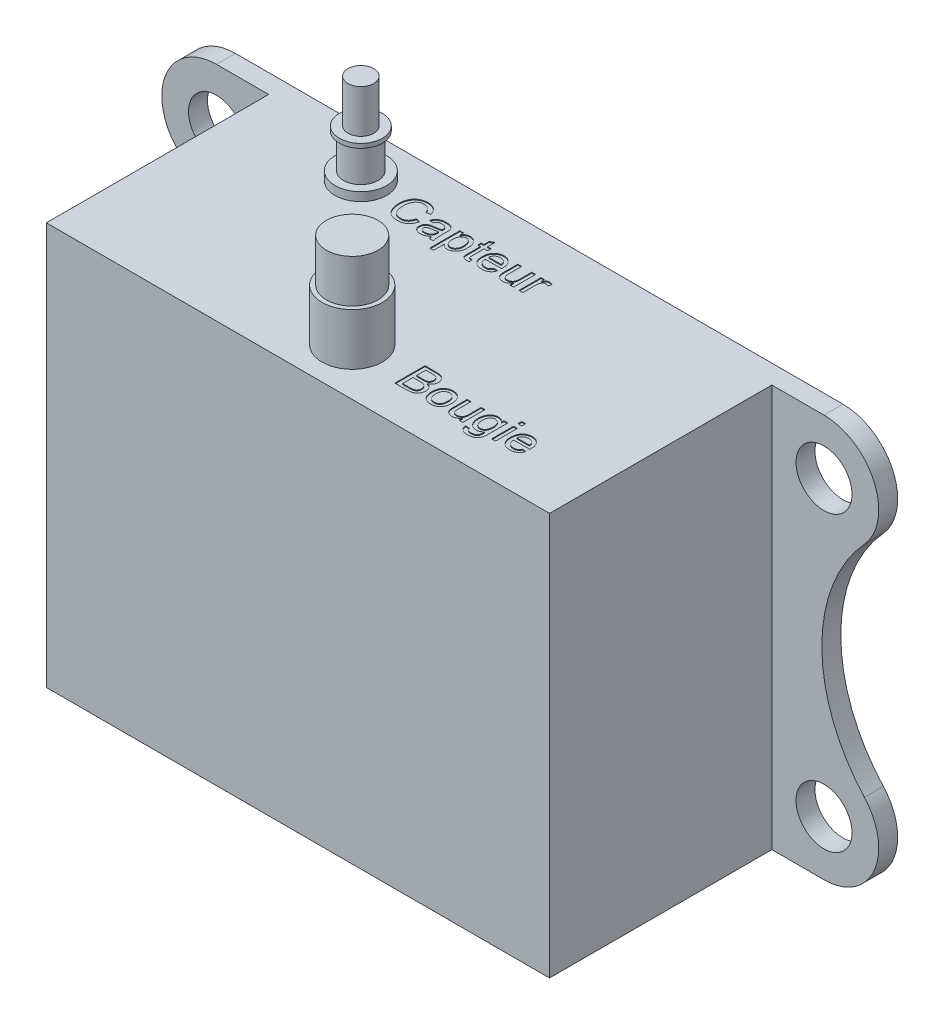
from build123d import *

# Parameters (mm, degrees)
ESQUISSE1_W             = 58.4
ESQUISSE1_H             = 46.7
BOSS_EXTRU_1_DEPTH      = 28
ESQUISSE2_R             = 3.25
BOSS_EXTRU_2_DEPTH      = 2.2
ESQUISSE3_R             = 3
BOSS_EXTRU_3_DEPTH      = 1
ESQUISSE4_R             = 2
BOSS_EXTRU_4_DEPTH      = 4
ESQUISSE5_R             = 2.5
BOSS_EXTRU_5_DEPTH      = 0.5
ESQUISSE6_R             = 1.5
BOSS_EXTRU_6_DEPTH      = 5
ESQUISSE7_R             = 3.5
BOSS_EXTRU_7_DEPTH      = 6
ESQUISSE8_R             = 3
BOSS_EXTRU_8_DEPTH      = 5
ESQUISSE9_W             = 7
ESQUISSE9_H             = 3.7
BOSS_EXTRU_9_DEPTH      = 1
ESQUISSE10_W            = 5
ESQUISSE10_H            = 2.75
BOSS_EXTRU_10_DEPTH     = 5
ESQUISSE11_W            = 5.5
ESQUISSE11_H            = 3
BOSS_EXTRU_11_DEPTH     = 0.5
ESQUISSE12_R            = 0.65
BOSS_EXTRU_12_DEPTH     = 5
ENL_V_MAT_EXTRU_1_DEPTH = 0.1
ESQUISSE14_W            = 0.448717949
ESQUISSE14_H            = 0.448717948
ESQUISSE14_H_2          = 2.557692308
ENL_V_MAT_EXTRU_2_DEPTH = 0.1


with BuildPart() as part:
    # Esquisse1 → Boss.-Extru.1 (new body)
    with BuildSketch(Plane.XY):
        Rectangle(ESQUISSE1_W, ESQUISSE1_H)
    extrude(amount=BOSS_EXTRU_1_DEPTH)

    # Esquisse2 → Boss.-Extru.2 (add)
    # profile 1 of 2: a face of its own
    with BuildSketch(Plane(origin=(0, 0, 0), x_dir=(-1, 0, 0), z_dir=(0, 0, -1))):
        with BuildLine():
            Line((29.2, 23.35), (35.25, 23.35))
            ThreePointArc((35.25, 23.35), (41.060797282, 19.560690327), (39.936504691, 12.715239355))
            ThreePointArc((39.936504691, 12.715239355), (35, 0), (39.936504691, -12.715239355))
            ThreePointArc((39.936504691, -12.715239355), (41.060797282, -19.560690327), (35.25, -23.35))
            Line((35.25, -23.35), (29.2, -23.35))
            Line((29.2, -23.35), (29.2, 23.35))
        make_face()
        with Locations((35.25, 17)):
            Circle(ESQUISSE2_R, mode=Mode.SUBTRACT)
        with Locations((35.25, -17)):
            Circle(ESQUISSE2_R, mode=Mode.SUBTRACT)
    # profile 2 of 2: a face of its own
    with BuildSketch(Plane(origin=(0, 0, 0), x_dir=(-1, 0, 0), z_dir=(0, 0, -1))):
        with BuildLine():
            Line((-29.2, -23.35), (-35.25, -23.35))
            ThreePointArc((-35.25, -23.35), (-41.060797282, -19.560690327), (-39.936504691, -12.715239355))
            ThreePointArc((-39.936504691, -12.715239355), (-35, 0), (-39.936504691, 12.715239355))
            ThreePointArc((-39.936504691, 12.715239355), (-41.060797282, 19.560690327), (-35.25, 23.35))
            Line((-35.25, 23.35), (-29.2, 23.35))
            Line((-29.2, 23.35), (-29.2, -23.35))
        make_face()
        with Locations(Location((-35.25, -17, 0), (0, 0, 180))):
            Circle(ESQUISSE2_R, mode=Mode.SUBTRACT)
        with Locations(Location((-35.25, 17, 0), (0, 0, 180))):
            Circle(ESQUISSE2_R, mode=Mode.SUBTRACT)
    extrude(amount=-BOSS_EXTRU_2_DEPTH)

    # Esquisse13 → Enl_v. mat.-Extru.1 (cut)
    # profile 1 of 9: a face of its own
    with BuildSketch(Plane.XZ.offset(23.35)):
        with BuildLine():
            Line((-3.796297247, 2.786927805), (-3.796297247, 6.286927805))
            Line((-3.796297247, 6.286927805), (-2.27766744, 6.286927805))
            add(Edge.make_bspline(
                [(-2.27766744, 6.286927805), (-2.241908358, 6.286647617), (-2.17270084, 6.286105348), (-2.072335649, 6.282266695), (-1.978654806, 6.273991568), (-1.891486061, 6.26504317), (-1.810844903, 6.251308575), (-1.736814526, 6.235555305), (-1.669280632, 6.216808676), (-1.607941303, 6.194667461), (-1.55103178, 6.169617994), (-1.498280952, 6.138710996), (-1.447496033, 6.104843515), (-1.40056183, 6.06505428), (-1.356240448, 6.021488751), (-1.314572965, 5.973554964), (-1.276176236, 5.920836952), (-1.228818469, 5.845386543), (-1.178013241, 5.744902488), (-1.135684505, 5.61630467), (-1.108391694, 5.481786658), (-1.105471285, 5.38985918), (-1.103989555, 5.343217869)],
                knots=[0, 0, 0, 0, 1.242255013, 2.404239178, 3.487702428, 4.508875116, 5.447164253, 6.327763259, 7.137389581, 7.87956647, 8.591787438, 9.293660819, 10.000726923, 10.709654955, 11.427269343, 12.158170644, 12.913245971, 13.690346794, 15.251572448, 16.809945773, 18.381459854, 20, 20, 20, 20], degree=3))
            add(Edge.make_bspline(
                [(-1.103989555, 5.343217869), (-1.104674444, 5.313278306), (-1.106027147, 5.254145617), (-1.116388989, 5.167204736), (-1.135137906, 5.084136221), (-1.159179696, 5.004212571), (-1.192085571, 4.928566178), (-1.2302056, 4.855651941), (-1.277430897, 4.787473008), (-1.330304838, 4.722213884), (-1.39093707, 4.661272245), (-1.459860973, 4.606846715), (-1.536393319, 4.557890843), (-1.620894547, 4.515755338), (-1.712391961, 4.477241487), (-1.812033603, 4.446228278), (-1.919417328, 4.420903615), (-1.993860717, 4.408640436), (-2.032274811, 4.40231242)],
                knots=[0, 0, 0, 0, 0.982609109, 1.940720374, 2.867584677, 3.775009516, 4.675469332, 5.571146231, 6.471115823, 7.392408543, 8.32534739, 9.286126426, 10.269214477, 11.301811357, 12.381622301, 13.524260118, 14.722474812, 16, 16, 16, 16], degree=3))
            add(Edge.make_bspline(
                [(-2.032274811, 4.40231242), (-2.004096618, 4.388077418), (-1.950585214, 4.361044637), (-1.876498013, 4.318657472), (-1.813696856, 4.275348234), (-1.777312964, 4.244372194), (-1.760239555, 4.229836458)],
                knots=[0, 0, 0, 0, 1.172304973, 2.226249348, 3.167654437, 4, 4, 4, 4], degree=3))
            add(Edge.make_bspline(
                [(-1.760239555, 4.229836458), (-1.727175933, 4.197424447), (-1.659260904, 4.130847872), (-1.565671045, 4.017448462), (-1.474932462, 3.891217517), (-1.419801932, 3.799989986), (-1.391449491, 3.753073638)],
                knots=[0, 0, 0, 0, 0.918110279, 1.885863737, 2.912745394, 4, 4, 4, 4], degree=3))
            Line((-1.391449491, 3.753073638), (-0.817230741, 2.786927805))
            Line((-0.817230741, 2.786927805), (-1.383036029, 2.786927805))
            Line((-1.383036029, 2.786927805), (-1.819133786, 3.525910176))
            add(Edge.make_bspline(
                [(-1.819133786, 3.525910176), (-1.834813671, 3.551838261), (-1.865198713, 3.602082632), (-1.909088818, 3.675462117), (-1.952121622, 3.743019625), (-1.992033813, 3.806685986), (-2.030445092, 3.865305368), (-2.066984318, 3.919081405), (-2.100645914, 3.968719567), (-2.142340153, 4.026511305), (-2.190865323, 4.090458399), (-2.247490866, 4.156311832), (-2.301415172, 4.208815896), (-2.36782395, 4.260301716), (-2.450081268, 4.308458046), (-2.520001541, 4.330584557), (-2.553909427, 4.341314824)],
                knots=[0, 0, 0, 0, 1.130940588, 2.191577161, 3.191089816, 4.120344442, 4.99615009, 5.80661983, 6.546979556, 7.234477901, 8.466216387, 9.541989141, 10.473533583, 11.269175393, 12.675684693, 14, 14, 14, 14], degree=3))
            add(Edge.make_bspline(
                [(-2.553909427, 4.341314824), (-2.568135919, 4.343880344), (-2.600615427, 4.349737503), (-2.65576555, 4.353562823), (-2.72258669, 4.357622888), (-2.771013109, 4.357504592), (-2.79719869, 4.357440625)],
                knots=[0, 0, 0, 0, 0.709978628, 1.620902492, 2.713552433, 4, 4, 4, 4], degree=3))
            Line((-2.79719869, 4.357440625), (-3.302707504, 4.357440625))
            Line((-3.302707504, 4.357440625), (-3.302707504, 2.786927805))
            Line((-3.302707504, 2.786927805), (-3.796297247, 2.786927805))
        make_face()
        with BuildLine():
            Line((-3.302707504, 4.761286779), (-2.365307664, 4.761286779))
            add(Edge.make_bspline(
                [(-2.365307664, 4.761286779), (-2.318302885, 4.762022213), (-2.23043186, 4.763397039), (-2.107558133, 4.775136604), (-2.002842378, 4.793791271), (-1.914214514, 4.821001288), (-1.839753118, 4.858777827), (-1.774992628, 4.904815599), (-1.721175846, 4.962482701), (-1.676405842, 5.027547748), (-1.641605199, 5.099148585), (-1.616501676, 5.174354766), (-1.600070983, 5.252534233), (-1.598417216, 5.305742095), (-1.597579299, 5.332701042)],
                knots=[0, 0, 0, 0, 1.546323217, 2.890706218, 4.056530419, 5.041445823, 5.928701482, 6.793137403, 7.641659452, 8.509781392, 9.383301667, 10.251423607, 11.114044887, 12, 12, 12, 12], degree=3))
            add(Edge.make_bspline(
                [(-1.597579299, 5.332701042), (-1.598230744, 5.352347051), (-1.599506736, 5.390827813), (-1.606195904, 5.447306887), (-1.619201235, 5.500975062), (-1.636374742, 5.552116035), (-1.659322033, 5.600355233), (-1.686582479, 5.646066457), (-1.719112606, 5.688996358), (-1.756373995, 5.729275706), (-1.799156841, 5.765925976), (-1.848024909, 5.79754721), (-1.902592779, 5.824418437), (-1.962923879, 5.845745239), (-2.028828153, 5.86280321), (-2.100680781, 5.874151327), (-2.178153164, 5.882362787), (-2.231837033, 5.882837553), (-2.259438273, 5.883081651)],
                knots=[0, 0, 0, 0, 0.965208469, 1.890559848, 2.786986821, 3.67262109, 4.535197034, 5.405224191, 6.282113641, 7.175449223, 8.095446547, 9.040936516, 10.026471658, 11.075712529, 12.17809725, 13.364958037, 14.645208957, 16, 16, 16, 16], degree=3))
            Line((-2.259438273, 5.883081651), (-3.302707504, 5.883081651))
            Line((-3.302707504, 5.883081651), (-3.302707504, 4.761286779))
        make_face(mode=Mode.SUBTRACT)
    # profile 2 of 9: a face of its own
    with BuildSketch(Plane.XZ.offset(23.35)):
        with BuildLine():
            Line((1.35905131, 3.549748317), (1.798654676, 3.504876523))
            add(Edge.make_bspline(
                [(1.798654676, 3.504876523), (1.789641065, 3.475224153), (1.771909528, 3.416892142), (1.735932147, 3.334159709), (1.696397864, 3.255559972), (1.649688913, 3.182805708), (1.598437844, 3.114348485), (1.541629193, 3.050734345), (1.478021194, 2.993568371), (1.409978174, 2.940463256), (1.336367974, 2.893792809), (1.257966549, 2.852588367), (1.17448682, 2.818582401), (1.086167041, 2.790253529), (0.992805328, 2.768647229), (0.894574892, 2.753720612), (0.791605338, 2.743145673), (0.721292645, 2.742425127), (0.685273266, 2.74205601)],
                knots=[0, 0, 0, 0, 1.017198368, 2.001028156, 2.958938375, 3.904526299, 4.836491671, 5.766019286, 6.700699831, 7.641977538, 8.598163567, 9.559604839, 10.547559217, 11.555094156, 12.60347703, 13.691418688, 14.817373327, 16, 16, 16, 16], degree=3))
            add(Edge.make_bspline(
                [(0.685273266, 2.74205601), (0.640115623, 2.743117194), (0.552072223, 2.745186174), (0.423495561, 2.761784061), (0.302044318, 2.788040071), (0.187453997, 2.825240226), (0.08045894, 2.87371884), (-0.019212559, 2.933342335), (-0.112180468, 3.002733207), (-0.197106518, 3.083113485), (-0.273944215, 3.172698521), (-0.339566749, 3.272309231), (-0.396480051, 3.379558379), (-0.441745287, 3.496188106), (-0.477523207, 3.621030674), (-0.502347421, 3.754617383), (-0.51822995, 3.896418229), (-0.519833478, 3.993981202), (-0.520656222, 4.044039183)],
                knots=[0, 0, 0, 0, 1.077616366, 2.10101772, 3.089143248, 4.040031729, 4.971276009, 5.886882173, 6.807369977, 7.734796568, 8.672701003, 9.618074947, 10.576315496, 11.565652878, 12.598619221, 13.67195277, 14.805516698, 16, 16, 16, 16], degree=3))
            add(Edge.make_bspline(
                [(-0.520656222, 4.044039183), (-0.519825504, 4.095961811), (-0.518212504, 4.196779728), (-0.502533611, 4.343570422), (-0.47660396, 4.481392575), (-0.441418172, 4.610746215), (-0.394794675, 4.731006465), (-0.337905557, 4.842129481), (-0.271102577, 4.944716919), (-0.193740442, 5.037266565), (-0.108138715, 5.119565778), (-0.017017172, 5.192747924), (0.081536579, 5.253142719), (0.185508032, 5.303286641), (0.295899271, 5.341812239), (0.412030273, 5.370184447), (0.534785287, 5.386194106), (0.618621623, 5.388377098), (0.661435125, 5.389491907)],
                knots=[0, 0, 0, 0, 1.232307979, 2.392766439, 3.499416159, 4.558769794, 5.570548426, 6.555643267, 7.517416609, 8.470735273, 9.412423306, 10.33263532, 11.239503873, 12.150233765, 13.067967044, 14.009932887, 14.983713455, 16, 16, 16, 16], degree=3))
            add(Edge.make_bspline(
                [(0.661435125, 5.389491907), (0.702858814, 5.388426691), (0.783926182, 5.386342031), (0.902692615, 5.369610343), (1.015862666, 5.343464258), (1.123198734, 5.305488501), (1.224160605, 5.255638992), (1.319838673, 5.196142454), (1.409564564, 5.125276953), (1.492762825, 5.044008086), (1.568568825, 4.953248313), (1.634142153, 4.852645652), (1.689666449, 4.743614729), (1.7346772, 4.625321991), (1.769324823, 4.498449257), (1.794426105, 4.362913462), (1.810256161, 4.21876069), (1.811855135, 4.119569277), (1.812677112, 4.068578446)],
                knots=[0, 0, 0, 0, 1.005323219, 1.967446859, 2.906060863, 3.821317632, 4.724696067, 5.63467896, 6.55185077, 7.494776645, 8.453732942, 9.416859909, 10.403972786, 11.418730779, 12.484189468, 13.592581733, 14.76243057, 16, 16, 16, 16], degree=3))
            add(Edge.make_bspline(
                [(1.812677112, 4.068578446), (1.812463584, 4.052685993), (1.811948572, 4.014354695), (1.811081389, 3.976029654), (1.810573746, 3.953594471)],
                knots=[0, 0, 0, 0, 0.829215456, 2, 2, 2, 2], degree=3))
            Line((1.810573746, 3.953594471), (-0.071938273, 3.953594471))
            add(Edge.make_bspline(
                [(-0.071938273, 3.953594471), (-0.069340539, 3.92199316), (-0.064258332, 3.860168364), (-0.049437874, 3.770657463), (-0.029437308, 3.686535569), (-0.002514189, 3.608543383), (0.029290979, 3.535807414), (0.068596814, 3.469524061), (0.112386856, 3.408221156), (0.162700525, 3.353393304), (0.216998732, 3.304624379), (0.275104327, 3.261843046), (0.336914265, 3.226359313), (0.401534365, 3.196528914), (0.469568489, 3.174081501), (0.540706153, 3.158017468), (0.61534438, 3.147967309), (0.666311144, 3.146599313), (0.692284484, 3.145902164)],
                knots=[0, 0, 0, 0, 1.224729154, 2.396059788, 3.502114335, 4.561587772, 5.580251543, 6.563724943, 7.533714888, 8.486186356, 9.43260269, 10.350144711, 11.268619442, 12.181885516, 13.095687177, 14.031096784, 14.996620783, 16, 16, 16, 16], degree=3))
            add(Edge.make_bspline(
                [(0.692284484, 3.145902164), (0.730207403, 3.147171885), (0.80367368, 3.149631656), (0.90967886, 3.166888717), (1.006849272, 3.197316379), (1.095867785, 3.239553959), (1.176586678, 3.295543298), (1.247020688, 3.367208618), (1.309641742, 3.452144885), (1.342211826, 3.516483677), (1.35905131, 3.549748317)],
                knots=[0, 0, 0, 0, 1.096312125, 2.123833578, 3.094060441, 4.030938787, 4.962563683, 5.918139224, 6.923629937, 8, 8, 8, 8], degree=3))
        make_face()
        with BuildLine():
            Line((-0.071938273, 4.357440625), (1.363959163, 4.357440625))
            add(Edge.make_bspline(
                [(1.363959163, 4.357440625), (1.3611346, 4.379673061), (1.35561196, 4.423142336), (1.343987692, 4.48601521), (1.328484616, 4.544593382), (1.309813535, 4.59865683), (1.287045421, 4.648309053), (1.261321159, 4.693626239), (1.232577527, 4.735092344), (1.210237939, 4.759190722), (1.199195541, 4.771102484)],
                knots=[0, 0, 0, 0, 1.185316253, 2.317552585, 3.379013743, 4.387694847, 5.339152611, 6.263729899, 7.141766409, 8, 8, 8, 8], degree=3))
            add(Edge.make_bspline(
                [(1.199195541, 4.771102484), (1.181552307, 4.788322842), (1.146703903, 4.822335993), (1.088602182, 4.866181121), (1.02615999, 4.902541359), (0.960591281, 4.933913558), (0.890429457, 4.956641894), (0.81707926, 4.973811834), (0.739519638, 4.983538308), (0.686467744, 4.984932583), (0.659331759, 4.985645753)],
                knots=[0, 0, 0, 0, 0.989486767, 1.954405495, 2.91383024, 3.888017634, 4.867526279, 5.869356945, 6.910178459, 8, 8, 8, 8], degree=3))
            add(Edge.make_bspline(
                [(0.659331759, 4.985645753), (0.634771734, 4.985075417), (0.586697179, 4.983959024), (0.515872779, 4.976102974), (0.447992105, 4.963079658), (0.383175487, 4.943756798), (0.321186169, 4.920272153), (0.262460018, 4.890251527), (0.20658596, 4.855368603), (0.153786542, 4.81546728), (0.106022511, 4.770750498), (0.062341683, 4.723117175), (0.026178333, 4.670471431), (-0.005885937, 4.61526621), (-0.030992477, 4.555778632), (-0.050757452, 4.492885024), (-0.06482703, 4.426412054), (-0.069546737, 4.380635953), (-0.071938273, 4.357440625)],
                knots=[0, 0, 0, 0, 1.10270868, 2.158476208, 3.195774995, 4.201977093, 5.192014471, 6.168217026, 7.158254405, 8.146844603, 9.134487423, 10.093158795, 11.042305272, 11.996428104, 12.955501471, 13.934632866, 14.95345241, 16, 16, 16, 16], degree=3))
        make_face(mode=Mode.SUBTRACT)
    # profile 3 of 9: a face of its own
    with BuildSketch(Plane.XZ.offset(23.35)):
        with BuildLine():
            Line((3.921651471, 3.729235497), (4.370369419, 3.684363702))
            add(Edge.make_bspline(
                [(4.370369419, 3.684363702), (4.364159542, 3.648486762), (4.351961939, 3.57801634), (4.324266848, 3.47606969), (4.290207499, 3.380106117), (4.249076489, 3.290064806), (4.201771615, 3.206096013), (4.147228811, 3.128188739), (4.085922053, 3.056391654), (4.018398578, 2.990768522), (3.945005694, 2.932626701), (3.86803488, 2.88092094), (3.786217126, 2.838322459), (3.700885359, 2.802886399), (3.611402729, 2.775602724), (3.517836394, 2.755797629), (3.420145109, 2.744784), (3.353768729, 2.742974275), (3.320088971, 2.74205601)],
                knots=[0, 0, 0, 0, 1.126290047, 2.212288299, 3.264625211, 4.274421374, 5.27199577, 6.243132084, 7.212758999, 8.189695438, 9.152066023, 10.106906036, 11.054818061, 12.001736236, 12.962610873, 13.945632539, 14.95760209, 16, 16, 16, 16], degree=3))
            add(Edge.make_bspline(
                [(3.320088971, 2.74205601), (3.277979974, 2.743229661), (3.195345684, 2.745532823), (3.074531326, 2.760744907), (2.960171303, 2.7875556), (2.852284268, 2.824811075), (2.750431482, 2.87253915), (2.655664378, 2.932058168), (2.566397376, 3.001090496), (2.484573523, 3.081069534), (2.41064095, 3.170905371), (2.346777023, 3.270706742), (2.291638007, 3.378981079), (2.247729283, 3.496970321), (2.213406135, 3.623727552), (2.189156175, 3.759790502), (2.17429388, 3.904885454), (2.172547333, 4.004739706), (2.171651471, 4.055958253)],
                knots=[0, 0, 0, 0, 1.023197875, 2.007913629, 2.952854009, 3.872368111, 4.776711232, 5.679644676, 6.586124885, 7.513792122, 8.45395957, 9.406953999, 10.38727148, 11.400874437, 12.46026104, 13.574150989, 14.755701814, 16, 16, 16, 16], degree=3))
            add(Edge.make_bspline(
                [(2.171651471, 4.055958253), (2.172045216, 4.089622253), (2.172822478, 4.156075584), (2.179281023, 4.254100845), (2.189642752, 4.348878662), (2.204505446, 4.440346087), (2.223014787, 4.528753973), (2.247253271, 4.613500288), (2.27448749, 4.695298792), (2.305845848, 4.77361406), (2.341566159, 4.848292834), (2.381970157, 4.918270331), (2.427392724, 4.983144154), (2.476309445, 5.043871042), (2.530547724, 5.099212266), (2.588901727, 5.149899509), (2.651519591, 5.19565476), (2.74038789, 5.249513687), (2.857879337, 5.305461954), (3.006197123, 5.354279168), (3.16093459, 5.383803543), (3.266209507, 5.387582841), (3.319387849, 5.389491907)],
                knots=[0, 0, 0, 0, 1.013805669, 2.001270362, 2.957354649, 3.884259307, 4.791280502, 5.67595866, 6.537369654, 7.386966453, 8.214944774, 9.028648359, 9.817495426, 10.598008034, 11.374511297, 12.14791384, 12.923651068, 13.707109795, 15.274991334, 16.830882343, 18.399158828, 20, 20, 20, 20], degree=3))
            add(Edge.make_bspline(
                [(3.319387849, 5.389491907), (3.352832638, 5.388791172), (3.418466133, 5.387416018), (3.514309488, 5.37747229), (3.605804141, 5.361468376), (3.692352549, 5.338446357), (3.774584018, 5.3089048), (3.85173651, 5.272352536), (3.924327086, 5.229483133), (3.99189867, 5.180132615), (4.054387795, 5.124970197), (4.110443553, 5.063453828), (4.161658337, 4.997170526), (4.206072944, 4.924725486), (4.246055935, 4.84721298), (4.278298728, 4.76352643), (4.306375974, 4.67492904), (4.319038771, 4.613256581), (4.325497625, 4.5817996)],
                knots=[0, 0, 0, 0, 1.132709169, 2.22287732, 3.260172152, 4.27594812, 5.252565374, 6.215743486, 7.163376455, 8.103906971, 9.045968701, 9.981589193, 10.918916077, 11.878868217, 12.855998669, 13.868839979, 14.912969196, 16, 16, 16, 16], degree=3))
            Line((4.325497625, 4.5817996), (3.876779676, 4.536927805))
            add(Edge.make_bspline(
                [(3.876779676, 4.536927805), (3.866374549, 4.572362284), (3.846474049, 4.640133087), (3.800883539, 4.732547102), (3.74373236, 4.810702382), (3.675581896, 4.874745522), (3.598007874, 4.924147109), (3.513104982, 4.960395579), (3.420009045, 4.981970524), (3.355494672, 4.984394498), (3.322192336, 4.985645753)],
                knots=[0, 0, 0, 0, 1.141726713, 2.183628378, 3.172002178, 4.124091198, 5.061356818, 6.004746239, 6.970049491, 8, 8, 8, 8], degree=3))
            add(Edge.make_bspline(
                [(3.322192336, 4.985645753), (3.296673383, 4.985034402), (3.246811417, 4.983839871), (3.174109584, 4.972678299), (3.104719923, 4.956440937), (3.039408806, 4.931324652), (2.977158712, 4.900511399), (2.918693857, 4.86252421), (2.864417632, 4.817049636), (2.813774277, 4.765194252), (2.767694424, 4.705740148), (2.727637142, 4.638280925), (2.695006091, 4.562377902), (2.667620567, 4.479082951), (2.645940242, 4.38763495), (2.630912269, 4.287976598), (2.621680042, 4.180466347), (2.620815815, 4.106224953), (2.620369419, 4.067877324)],
                knots=[0, 0, 0, 0, 0.934506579, 1.825950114, 2.690068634, 3.541100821, 4.383731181, 5.231784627, 6.089299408, 6.973555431, 7.883203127, 8.839396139, 9.840301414, 10.904673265, 12.049269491, 13.27993044, 14.595012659, 16, 16, 16, 16], degree=3))
            add(Edge.make_bspline(
                [(2.620369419, 4.067877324), (2.620783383, 4.028825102), (2.621580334, 3.95364293), (2.631129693, 3.845044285), (2.645217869, 3.744403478), (2.666448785, 3.652197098), (2.691811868, 3.567488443), (2.724973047, 3.491738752), (2.763405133, 3.423757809), (2.807990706, 3.364406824), (2.857385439, 3.312811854), (2.911040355, 3.26883819), (2.967370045, 3.230141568), (3.028040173, 3.19939446), (3.092229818, 3.175303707), (3.160053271, 3.158808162), (3.231153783, 3.147757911), (3.279848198, 3.146528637), (3.304664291, 3.145902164)],
                knots=[0, 0, 0, 0, 1.439417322, 2.771123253, 4.016540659, 5.182963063, 6.256782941, 7.271700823, 8.22505475, 9.129818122, 10.001307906, 10.851929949, 11.68361798, 12.516019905, 13.353091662, 14.205762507, 15.085604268, 16, 16, 16, 16], degree=3))
            add(Edge.make_bspline(
                [(3.304664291, 3.145902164), (3.324553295, 3.146226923), (3.363759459, 3.146867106), (3.421401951, 3.154311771), (3.476557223, 3.165229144), (3.52923, 3.180725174), (3.579069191, 3.20130653), (3.626782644, 3.225756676), (3.672124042, 3.254551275), (3.71401087, 3.288577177), (3.753989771, 3.326178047), (3.788602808, 3.370199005), (3.820559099, 3.418116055), (3.848481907, 3.471050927), (3.873233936, 3.528621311), (3.893048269, 3.591234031), (3.910486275, 3.658292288), (3.917850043, 3.705081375), (3.921651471, 3.729235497)],
                knots=[0, 0, 0, 0, 1.014969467, 2.000756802, 2.962635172, 3.883905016, 4.799126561, 5.711777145, 6.618793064, 7.535724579, 8.464077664, 9.414562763, 10.387627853, 11.401965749, 12.465912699, 13.582944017, 14.752233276, 16, 16, 16, 16], degree=3))
        make_face()
    # profile 4 of 9: a face of its own
    with BuildSketch(Plane.XZ.offset(23.35)):
        with BuildLine():
            Line((6.474435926, 3.549748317), (6.914039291, 3.504876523))
            add(Edge.make_bspline(
                [(6.914039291, 3.504876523), (6.90502568, 3.475224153), (6.887294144, 3.416892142), (6.851316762, 3.334159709), (6.811782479, 3.255559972), (6.765073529, 3.182805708), (6.71382246, 3.114348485), (6.657013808, 3.050734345), (6.593405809, 2.993568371), (6.525362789, 2.940463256), (6.45175259, 2.893792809), (6.373351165, 2.852588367), (6.289871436, 2.818582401), (6.201551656, 2.790253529), (6.108189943, 2.768647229), (6.009959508, 2.753720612), (5.906989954, 2.743145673), (5.836677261, 2.742425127), (5.800657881, 2.74205601)],
                knots=[0, 0, 0, 0, 1.017198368, 2.001028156, 2.958938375, 3.904526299, 4.836491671, 5.766019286, 6.700699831, 7.641977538, 8.598163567, 9.559604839, 10.547559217, 11.555094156, 12.60347703, 13.691418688, 14.817373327, 16, 16, 16, 16], degree=3))
            add(Edge.make_bspline(
                [(5.800657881, 2.74205601), (5.755500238, 2.743117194), (5.667456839, 2.745186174), (5.538880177, 2.761784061), (5.417428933, 2.788040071), (5.302838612, 2.825240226), (5.195843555, 2.87371884), (5.096172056, 2.933342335), (5.003204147, 3.002733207), (4.918278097, 3.083113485), (4.8414404, 3.172698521), (4.775817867, 3.272309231), (4.718904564, 3.379558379), (4.673639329, 3.496188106), (4.637861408, 3.621030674), (4.613037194, 3.754617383), (4.597154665, 3.896418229), (4.595551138, 3.993981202), (4.594728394, 4.044039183)],
                knots=[0, 0, 0, 0, 1.077616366, 2.10101772, 3.089143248, 4.040031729, 4.971276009, 5.886882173, 6.807369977, 7.734796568, 8.672701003, 9.618074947, 10.576315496, 11.565652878, 12.598619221, 13.67195277, 14.805516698, 16, 16, 16, 16], degree=3))
            add(Edge.make_bspline(
                [(4.594728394, 4.044039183), (4.595559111, 4.095961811), (4.597172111, 4.196779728), (4.612851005, 4.343570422), (4.638780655, 4.481392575), (4.673966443, 4.610746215), (4.72058994, 4.731006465), (4.777479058, 4.842129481), (4.844282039, 4.944716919), (4.921644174, 5.037266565), (5.0072459, 5.119565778), (5.098367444, 5.192747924), (5.196921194, 5.253142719), (5.300892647, 5.303286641), (5.411283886, 5.341812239), (5.527414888, 5.370184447), (5.650169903, 5.386194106), (5.734006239, 5.388377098), (5.77681974, 5.389491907)],
                knots=[0, 0, 0, 0, 1.232307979, 2.392766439, 3.499416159, 4.558769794, 5.570548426, 6.555643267, 7.517416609, 8.470735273, 9.412423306, 10.33263532, 11.239503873, 12.150233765, 13.067967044, 14.009932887, 14.983713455, 16, 16, 16, 16], degree=3))
            add(Edge.make_bspline(
                [(5.77681974, 5.389491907), (5.818243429, 5.388426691), (5.899310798, 5.386342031), (6.018077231, 5.369610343), (6.131247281, 5.343464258), (6.238583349, 5.305488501), (6.339545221, 5.255638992), (6.435223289, 5.196142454), (6.52494918, 5.125276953), (6.608147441, 5.044008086), (6.68395344, 4.953248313), (6.749526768, 4.852645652), (6.805051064, 4.743614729), (6.850061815, 4.625321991), (6.884709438, 4.498449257), (6.90981072, 4.362913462), (6.925640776, 4.21876069), (6.92723975, 4.119569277), (6.928061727, 4.068578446)],
                knots=[0, 0, 0, 0, 1.005323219, 1.967446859, 2.906060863, 3.821317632, 4.724696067, 5.63467896, 6.55185077, 7.494776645, 8.453732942, 9.416859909, 10.403972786, 11.418730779, 12.484189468, 13.592581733, 14.76243057, 16, 16, 16, 16], degree=3))
            add(Edge.make_bspline(
                [(6.928061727, 4.068578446), (6.927848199, 4.052685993), (6.927333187, 4.014354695), (6.926466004, 3.976029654), (6.925958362, 3.953594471)],
                knots=[0, 0, 0, 0, 0.829215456, 2, 2, 2, 2], degree=3))
            Line((6.925958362, 3.953594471), (5.043446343, 3.953594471))
            add(Edge.make_bspline(
                [(5.043446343, 3.953594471), (5.046044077, 3.92199316), (5.051126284, 3.860168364), (5.065946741, 3.770657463), (5.085947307, 3.686535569), (5.112870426, 3.608543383), (5.144675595, 3.535807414), (5.18398143, 3.469524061), (5.227771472, 3.408221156), (5.27808514, 3.353393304), (5.332383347, 3.304624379), (5.390488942, 3.261843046), (5.45229888, 3.226359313), (5.516918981, 3.196528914), (5.584953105, 3.174081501), (5.656090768, 3.158017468), (5.730728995, 3.147967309), (5.781695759, 3.146599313), (5.807669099, 3.145902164)],
                knots=[0, 0, 0, 0, 1.224729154, 2.396059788, 3.502114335, 4.561587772, 5.580251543, 6.563724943, 7.533714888, 8.486186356, 9.43260269, 10.350144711, 11.268619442, 12.181885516, 13.095687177, 14.031096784, 14.996620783, 16, 16, 16, 16], degree=3))
            add(Edge.make_bspline(
                [(5.807669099, 3.145902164), (5.845592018, 3.147171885), (5.919058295, 3.149631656), (6.025063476, 3.166888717), (6.122233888, 3.197316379), (6.2112524, 3.239553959), (6.291971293, 3.295543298), (6.362405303, 3.367208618), (6.425026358, 3.452144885), (6.457596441, 3.516483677), (6.474435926, 3.549748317)],
                knots=[0, 0, 0, 0, 1.096312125, 2.123833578, 3.094060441, 4.030938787, 4.962563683, 5.918139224, 6.923629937, 8, 8, 8, 8], degree=3))
        make_face()
        with BuildLine():
            Line((5.043446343, 4.357440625), (6.479343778, 4.357440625))
            add(Edge.make_bspline(
                [(6.479343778, 4.357440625), (6.476519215, 4.379673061), (6.470996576, 4.423142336), (6.459372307, 4.48601521), (6.443869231, 4.544593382), (6.425198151, 4.59865683), (6.402430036, 4.648309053), (6.376705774, 4.693626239), (6.347962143, 4.735092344), (6.325622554, 4.759190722), (6.314580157, 4.771102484)],
                knots=[0, 0, 0, 0, 1.185316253, 2.317552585, 3.379013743, 4.387694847, 5.339152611, 6.263729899, 7.141766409, 8, 8, 8, 8], degree=3))
            add(Edge.make_bspline(
                [(6.314580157, 4.771102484), (6.296936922, 4.788322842), (6.262088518, 4.822335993), (6.203986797, 4.866181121), (6.141544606, 4.902541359), (6.075975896, 4.933913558), (6.005814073, 4.956641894), (5.932463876, 4.973811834), (5.854904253, 4.983538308), (5.801852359, 4.984932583), (5.774716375, 4.985645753)],
                knots=[0, 0, 0, 0, 0.989486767, 1.954405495, 2.91383024, 3.888017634, 4.867526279, 5.869356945, 6.910178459, 8, 8, 8, 8], degree=3))
            add(Edge.make_bspline(
                [(5.774716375, 4.985645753), (5.75015635, 4.985075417), (5.702081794, 4.983959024), (5.631257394, 4.976102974), (5.56337672, 4.963079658), (5.498560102, 4.943756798), (5.436570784, 4.920272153), (5.377844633, 4.890251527), (5.321970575, 4.855368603), (5.269171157, 4.81546728), (5.221407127, 4.770750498), (5.177726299, 4.723117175), (5.141562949, 4.670471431), (5.109498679, 4.61526621), (5.084392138, 4.555778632), (5.064627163, 4.492885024), (5.050557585, 4.426412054), (5.045837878, 4.380635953), (5.043446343, 4.357440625)],
                knots=[0, 0, 0, 0, 1.10270868, 2.158476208, 3.195774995, 4.201977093, 5.192014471, 6.168217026, 7.158254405, 8.146844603, 9.134487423, 10.093158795, 11.042305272, 11.996428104, 12.955501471, 13.934632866, 14.95345241, 16, 16, 16, 16], degree=3))
        make_face(mode=Mode.SUBTRACT)
    # profile 5 of 9: a face of its own
    with BuildSketch(Plane.XZ.offset(23.35)):
        with BuildLine():
            Line((7.421651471, 1.844620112), (7.421651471, 5.344620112))
            Line((7.421651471, 5.344620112), (7.870369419, 5.344620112))
            Line((7.870369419, 5.344620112), (7.870369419, 4.938670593))
            add(Edge.make_bspline(
                [(7.870369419, 4.938670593), (7.892874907, 4.974386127), (7.936228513, 5.043187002), (8.009249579, 5.136030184), (8.087607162, 5.213719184), (8.170498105, 5.278595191), (8.261195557, 5.328321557), (8.35981166, 5.364588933), (8.467762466, 5.385763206), (8.542650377, 5.38822246), (8.581306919, 5.389491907)],
                knots=[0, 0, 0, 0, 1.141868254, 2.199646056, 3.187916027, 4.121412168, 5.038483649, 5.974824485, 6.95462054, 8, 8, 8, 8], degree=3))
            add(Edge.make_bspline(
                [(8.581306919, 5.389491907), (8.607034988, 5.38891901), (8.657904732, 5.387786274), (8.733091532, 5.379800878), (8.806287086, 5.367421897), (8.877149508, 5.349233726), (8.945299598, 5.325276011), (9.010972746, 5.296080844), (9.074883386, 5.262810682), (9.135892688, 5.223295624), (9.193670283, 5.179090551), (9.249048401, 5.131632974), (9.299314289, 5.078300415), (9.347218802, 5.021867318), (9.390778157, 4.960614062), (9.430057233, 4.894702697), (9.466506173, 4.825104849), (9.509424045, 4.725886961), (9.555002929, 4.5957395), (9.592045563, 4.431497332), (9.616201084, 4.260467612), (9.618965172, 4.143916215), (9.620369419, 4.084704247)],
                knots=[0, 0, 0, 0, 0.824202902, 1.629620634, 2.419929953, 3.200854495, 3.970497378, 4.731532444, 5.501903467, 6.276628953, 7.056871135, 7.831705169, 8.610184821, 9.402088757, 10.202023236, 11.014889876, 11.858855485, 12.71721399, 14.476656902, 16.267557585, 18.103795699, 20, 20, 20, 20], degree=3))
            add(Edge.make_bspline(
                [(9.620369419, 4.084704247), (9.618884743, 4.02151027), (9.61597915, 3.897836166), (9.589340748, 3.717098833), (9.54602473, 3.545986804), (9.495534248, 3.410996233), (9.447135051, 3.309455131), (9.406100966, 3.238521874), (9.362100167, 3.171837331), (9.31419511, 3.109394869), (9.261397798, 3.052210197), (9.205433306, 2.998748), (9.145571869, 2.949972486), (9.061107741, 2.892937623), (8.951138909, 2.83320522), (8.813704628, 2.780271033), (8.672278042, 2.748326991), (8.576556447, 2.744145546), (8.528722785, 2.74205601)],
                knots=[0, 0, 0, 0, 1.566750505, 3.066217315, 4.520030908, 5.938083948, 6.632957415, 7.30813415, 7.968947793, 8.613647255, 9.257851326, 9.897527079, 10.532192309, 11.170526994, 12.423402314, 13.627070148, 14.814207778, 16, 16, 16, 16], degree=3))
            add(Edge.make_bspline(
                [(8.528722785, 2.74205601), (8.494022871, 2.743113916), (8.42613984, 2.745183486), (8.32721897, 2.766083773), (8.233318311, 2.797639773), (8.146444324, 2.844246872), (8.06611408, 2.899462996), (7.993029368, 2.962197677), (7.92677531, 3.031191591), (7.889222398, 3.082355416), (7.870369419, 3.108041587)],
                knots=[0, 0, 0, 0, 1.060500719, 2.074645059, 3.081194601, 4.082546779, 5.08044464, 6.05947861, 7.025785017, 8, 8, 8, 8], degree=3))
            Line((7.870369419, 3.108041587), (7.870369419, 1.844620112))
            Line((7.870369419, 1.844620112), (7.421651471, 1.844620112))
        make_face()
        with BuildLine():
            add(Edge.make_bspline(
                [(7.870369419, 4.044740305), (7.870802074, 4.007559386), (7.871638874, 3.935647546), (7.881027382, 3.831684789), (7.895486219, 3.735380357), (7.915565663, 3.646367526), (7.942152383, 3.564935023), (7.974321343, 3.490831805), (8.012343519, 3.424058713), (8.056478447, 3.365201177), (8.10539196, 3.314262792), (8.15572554, 3.268723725), (8.209263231, 3.230837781), (8.26507825, 3.199514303), (8.323704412, 3.175437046), (8.385002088, 3.158960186), (8.448392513, 3.147807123), (8.491515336, 3.146541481), (8.513298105, 3.145902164)],
                knots=[0, 0, 0, 0, 1.437434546, 2.78015081, 4.032764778, 5.2012756, 6.304456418, 7.34047555, 8.320212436, 9.269161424, 10.176980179, 11.047598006, 11.89018243, 12.707424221, 13.518042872, 14.333683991, 15.158288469, 16, 16, 16, 16], degree=3))
            add(Edge.make_bspline(
                [(8.513298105, 3.145902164), (8.535535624, 3.146584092), (8.579562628, 3.147934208), (8.644421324, 3.158452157), (8.706266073, 3.177144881), (8.76612062, 3.201566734), (8.822711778, 3.234500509), (8.878099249, 3.272860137), (8.929803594, 3.31994843), (8.979909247, 3.372954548), (9.025637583, 3.434001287), (9.064981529, 3.50331782), (9.097711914, 3.580399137), (9.125176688, 3.664802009), (9.145848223, 3.757345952), (9.161127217, 3.857351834), (9.170349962, 3.965340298), (9.171207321, 4.039813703), (9.171651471, 4.078394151)],
                knots=[0, 0, 0, 0, 0.83316913, 1.649551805, 2.453198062, 3.250183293, 4.066002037, 4.901882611, 5.770302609, 6.681184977, 7.632314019, 8.620852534, 9.660448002, 10.765528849, 11.942537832, 13.209677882, 14.554492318, 16, 16, 16, 16], degree=3))
            add(Edge.make_bspline(
                [(9.171651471, 4.078394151), (9.171210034, 4.115107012), (9.170353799, 4.186317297), (9.161026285, 4.289355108), (9.146367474, 4.38538587), (9.126543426, 4.474442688), (9.099879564, 4.556439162), (9.066821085, 4.631058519), (9.028285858, 4.698907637), (8.983907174, 4.759268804), (8.935727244, 4.812364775), (8.884635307, 4.85846639), (8.831760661, 4.897829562), (8.776101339, 4.929720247), (8.71854622, 4.955544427), (8.658030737, 4.972610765), (8.595507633, 4.983764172), (8.553077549, 4.985011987), (8.531527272, 4.985645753)],
                knots=[0, 0, 0, 0, 1.417753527, 2.749952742, 3.99222208, 5.168205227, 6.27013346, 7.316877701, 8.315654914, 9.278031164, 10.204687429, 11.080340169, 11.932552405, 12.745464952, 13.553904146, 14.362393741, 15.168258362, 16, 16, 16, 16], degree=3))
            add(Edge.make_bspline(
                [(8.531527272, 4.985645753), (8.509975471, 4.98504005), (8.467271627, 4.983839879), (8.404375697, 4.972144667), (8.34356659, 4.953221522), (8.285029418, 4.925981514), (8.227829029, 4.892116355), (8.172329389, 4.850795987), (8.119654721, 4.800811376), (8.068589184, 4.744590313), (8.021634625, 4.680965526), (7.980708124, 4.610214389), (7.946369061, 4.532597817), (7.918419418, 4.44803737), (7.896826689, 4.356751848), (7.881841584, 4.258735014), (7.871445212, 4.154104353), (7.870735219, 4.081927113), (7.870369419, 4.044740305)],
                knots=[0, 0, 0, 0, 0.806892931, 1.598819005, 2.388223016, 3.187667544, 4.012236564, 4.875742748, 5.774202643, 6.729148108, 7.718801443, 8.731210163, 9.785807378, 10.893572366, 12.063989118, 13.296455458, 14.607092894, 16, 16, 16, 16], degree=3))
        make_face(mode=Mode.SUBTRACT)
    # profile 6 of 9: a face of its own
    with BuildSketch(Plane.XZ.offset(23.35)):
        with BuildLine():
            Line((11.056266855, 3.157120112), (11.10113865, 2.780617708))
            add(Edge.make_bspline(
                [(11.10113865, 2.780617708), (11.072447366, 2.774690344), (11.016914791, 2.763217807), (10.935407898, 2.751758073), (10.858739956, 2.74300307), (10.809027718, 2.742365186), (10.784932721, 2.74205601)],
                knots=[0, 0, 0, 0, 1.101333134, 2.13165308, 3.094431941, 4, 4, 4, 4], degree=3))
            add(Edge.make_bspline(
                [(10.784932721, 2.74205601), (10.749138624, 2.743032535), (10.681483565, 2.744878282), (10.585979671, 2.757534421), (10.503137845, 2.780504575), (10.432269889, 2.812096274), (10.373426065, 2.852044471), (10.32391763, 2.897636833), (10.283838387, 2.948965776), (10.257280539, 2.99727784), (10.241646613, 3.042309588), (10.231314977, 3.084301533), (10.22342023, 3.134796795), (10.215535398, 3.192945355), (10.2100131, 3.259634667), (10.207133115, 3.334256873), (10.203768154, 3.417208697), (10.203725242, 3.475191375), (10.203702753, 3.505577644)],
                knots=[0, 0, 0, 0, 1.515965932, 2.865354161, 4.068592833, 5.144966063, 6.135994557, 7.067504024, 7.984224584, 8.88319335, 9.387210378, 9.999362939, 10.71208193, 11.550605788, 12.484373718, 13.544606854, 14.713232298, 16, 16, 16, 16], degree=3))
            Line((10.203702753, 3.505577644), (10.203702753, 4.940773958))
            Line((10.203702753, 4.940773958), (9.889600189, 4.940773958))
            Line((9.889600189, 4.940773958), (9.889600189, 5.344620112))
            Line((9.889600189, 5.344620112), (10.203702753, 5.344620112))
            Line((10.203702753, 5.344620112), (10.203702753, 5.967216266))
            Line((10.203702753, 5.967216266), (10.652420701, 6.2224246))
            Line((10.652420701, 6.2224246), (10.652420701, 5.344620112))
            Line((10.652420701, 5.344620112), (11.056266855, 5.344620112))
            Line((11.056266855, 5.344620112), (11.056266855, 4.940773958))
            Line((11.056266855, 4.940773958), (10.652420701, 4.940773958))
            Line((10.652420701, 4.940773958), (10.652420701, 3.489451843))
            add(Edge.make_bspline(
                [(10.652420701, 3.489451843), (10.652592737, 3.462098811), (10.652903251, 3.412728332), (10.657184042, 3.346750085), (10.662471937, 3.296646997), (10.673602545, 3.251281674), (10.699622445, 3.210137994), (10.734336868, 3.178916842), (10.769591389, 3.161241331), (10.802278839, 3.152729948), (10.839657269, 3.147058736), (10.866237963, 3.146302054), (10.880285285, 3.145902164)],
                knots=[0, 0, 0, 0, 1.693748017, 3.05710712, 4.093010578, 4.8128101, 5.929870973, 7.047775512, 7.662723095, 8.354621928, 9.130453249, 10, 10, 10, 10], degree=3))
            add(Edge.make_bspline(
                [(10.880285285, 3.145902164), (10.892206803, 3.146057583), (10.917935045, 3.146392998), (10.959310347, 3.148694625), (11.006064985, 3.152150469), (11.038979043, 3.155408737), (11.056266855, 3.157120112)],
                knots=[0, 0, 0, 0, 0.810958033, 1.750156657, 2.818290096, 4, 4, 4, 4], degree=3))
        make_face()
    # profile 7 of 9: a face of its own
    with BuildSketch(Plane.XZ.offset(23.35)):
        with BuildLine():
            Line((13.205205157, 3.549748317), (13.644808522, 3.504876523))
            add(Edge.make_bspline(
                [(13.644808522, 3.504876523), (13.635794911, 3.475224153), (13.618063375, 3.416892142), (13.582085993, 3.334159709), (13.54255171, 3.255559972), (13.49584276, 3.182805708), (13.44459169, 3.114348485), (13.387783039, 3.050734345), (13.32417504, 2.993568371), (13.25613202, 2.940463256), (13.18252182, 2.893792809), (13.104120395, 2.852588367), (13.020640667, 2.818582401), (12.932320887, 2.790253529), (12.838959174, 2.768647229), (12.740728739, 2.753720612), (12.637759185, 2.743145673), (12.567446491, 2.742425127), (12.531427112, 2.74205601)],
                knots=[0, 0, 0, 0, 1.017198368, 2.001028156, 2.958938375, 3.904526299, 4.836491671, 5.766019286, 6.700699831, 7.641977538, 8.598163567, 9.559604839, 10.547559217, 11.555094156, 12.60347703, 13.691418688, 14.817373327, 16, 16, 16, 16], degree=3))
            add(Edge.make_bspline(
                [(12.531427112, 2.74205601), (12.486269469, 2.743117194), (12.398226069, 2.745186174), (12.269649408, 2.761784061), (12.148198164, 2.788040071), (12.033607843, 2.825240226), (11.926612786, 2.87371884), (11.826941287, 2.933342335), (11.733973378, 3.002733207), (11.649047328, 3.083113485), (11.572209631, 3.172698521), (11.506587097, 3.272309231), (11.449673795, 3.379558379), (11.404408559, 3.496188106), (11.368630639, 3.621030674), (11.343806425, 3.754617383), (11.327923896, 3.896418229), (11.326320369, 3.993981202), (11.325497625, 4.044039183)],
                knots=[0, 0, 0, 0, 1.077616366, 2.10101772, 3.089143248, 4.040031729, 4.971276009, 5.886882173, 6.807369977, 7.734796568, 8.672701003, 9.618074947, 10.576315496, 11.565652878, 12.598619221, 13.67195277, 14.805516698, 16, 16, 16, 16], degree=3))
            add(Edge.make_bspline(
                [(11.325497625, 4.044039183), (11.326328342, 4.095961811), (11.327941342, 4.196779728), (11.343620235, 4.343570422), (11.369549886, 4.481392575), (11.404735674, 4.610746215), (11.451359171, 4.731006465), (11.508248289, 4.842129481), (11.575051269, 4.944716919), (11.652413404, 5.037266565), (11.738015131, 5.119565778), (11.829136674, 5.192747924), (11.927690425, 5.253142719), (12.031661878, 5.303286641), (12.142053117, 5.341812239), (12.258184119, 5.370184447), (12.380939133, 5.386194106), (12.46477547, 5.388377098), (12.507588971, 5.389491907)],
                knots=[0, 0, 0, 0, 1.232307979, 2.392766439, 3.499416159, 4.558769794, 5.570548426, 6.555643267, 7.517416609, 8.470735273, 9.412423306, 10.33263532, 11.239503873, 12.150233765, 13.067967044, 14.009932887, 14.983713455, 16, 16, 16, 16], degree=3))
            add(Edge.make_bspline(
                [(12.507588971, 5.389491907), (12.54901266, 5.388426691), (12.630080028, 5.386342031), (12.748846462, 5.369610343), (12.862016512, 5.343464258), (12.96935258, 5.305488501), (13.070314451, 5.255638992), (13.165992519, 5.196142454), (13.25571841, 5.125276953), (13.338916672, 5.044008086), (13.414722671, 4.953248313), (13.480295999, 4.852645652), (13.535820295, 4.743614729), (13.580831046, 4.625321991), (13.615478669, 4.498449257), (13.640579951, 4.362913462), (13.656410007, 4.21876069), (13.658008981, 4.119569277), (13.658830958, 4.068578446)],
                knots=[0, 0, 0, 0, 1.005323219, 1.967446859, 2.906060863, 3.821317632, 4.724696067, 5.63467896, 6.55185077, 7.494776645, 8.453732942, 9.416859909, 10.403972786, 11.418730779, 12.484189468, 13.592581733, 14.76243057, 16, 16, 16, 16], degree=3))
            add(Edge.make_bspline(
                [(13.658830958, 4.068578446), (13.65861743, 4.052685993), (13.658102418, 4.014354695), (13.657235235, 3.976029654), (13.656727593, 3.953594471)],
                knots=[0, 0, 0, 0, 0.829215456, 2, 2, 2, 2], degree=3))
            Line((13.656727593, 3.953594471), (11.774215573, 3.953594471))
            add(Edge.make_bspline(
                [(11.774215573, 3.953594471), (11.776813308, 3.92199316), (11.781895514, 3.860168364), (11.796715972, 3.770657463), (11.816716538, 3.686535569), (11.843639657, 3.608543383), (11.875444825, 3.535807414), (11.91475066, 3.469524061), (11.958540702, 3.408221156), (12.008854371, 3.353393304), (12.063152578, 3.304624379), (12.121258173, 3.261843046), (12.183068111, 3.226359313), (12.247688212, 3.196528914), (12.315722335, 3.174081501), (12.386859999, 3.158017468), (12.461498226, 3.147967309), (12.51246499, 3.146599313), (12.53843833, 3.145902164)],
                knots=[0, 0, 0, 0, 1.224729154, 2.396059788, 3.502114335, 4.561587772, 5.580251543, 6.563724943, 7.533714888, 8.486186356, 9.43260269, 10.350144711, 11.268619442, 12.181885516, 13.095687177, 14.031096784, 14.996620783, 16, 16, 16, 16], degree=3))
            add(Edge.make_bspline(
                [(12.53843833, 3.145902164), (12.576361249, 3.147171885), (12.649827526, 3.149631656), (12.755832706, 3.166888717), (12.853003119, 3.197316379), (12.942021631, 3.239553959), (13.022740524, 3.295543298), (13.093174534, 3.367208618), (13.155795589, 3.452144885), (13.188365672, 3.516483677), (13.205205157, 3.549748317)],
                knots=[0, 0, 0, 0, 1.096312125, 2.123833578, 3.094060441, 4.030938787, 4.962563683, 5.918139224, 6.923629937, 8, 8, 8, 8], degree=3))
        make_face()
        with BuildLine():
            Line((11.774215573, 4.357440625), (13.210113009, 4.357440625))
            add(Edge.make_bspline(
                [(13.210113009, 4.357440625), (13.207288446, 4.379673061), (13.201765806, 4.423142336), (13.190141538, 4.48601521), (13.174638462, 4.544593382), (13.155967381, 4.59865683), (13.133199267, 4.648309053), (13.107475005, 4.693626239), (13.078731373, 4.735092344), (13.056391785, 4.759190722), (13.045349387, 4.771102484)],
                knots=[0, 0, 0, 0, 1.185316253, 2.317552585, 3.379013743, 4.387694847, 5.339152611, 6.263729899, 7.141766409, 8, 8, 8, 8], degree=3))
            add(Edge.make_bspline(
                [(13.045349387, 4.771102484), (13.027706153, 4.788322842), (12.992857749, 4.822335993), (12.934756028, 4.866181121), (12.872313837, 4.902541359), (12.806745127, 4.933913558), (12.736583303, 4.956641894), (12.663233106, 4.973811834), (12.585673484, 4.983538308), (12.53262159, 4.984932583), (12.505485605, 4.985645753)],
                knots=[0, 0, 0, 0, 0.989486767, 1.954405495, 2.91383024, 3.888017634, 4.867526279, 5.869356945, 6.910178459, 8, 8, 8, 8], degree=3))
            add(Edge.make_bspline(
                [(12.505485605, 4.985645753), (12.48092558, 4.985075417), (12.432851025, 4.983959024), (12.362026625, 4.976102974), (12.294145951, 4.963079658), (12.229329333, 4.943756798), (12.167340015, 4.920272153), (12.108613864, 4.890251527), (12.052739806, 4.855368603), (11.999940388, 4.81546728), (11.952176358, 4.770750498), (11.908495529, 4.723117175), (11.872332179, 4.670471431), (11.840267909, 4.61526621), (11.815161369, 4.555778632), (11.795396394, 4.492885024), (11.781326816, 4.426412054), (11.776607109, 4.380635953), (11.774215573, 4.357440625)],
                knots=[0, 0, 0, 0, 1.10270868, 2.158476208, 3.195774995, 4.201977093, 5.192014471, 6.168217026, 7.158254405, 8.146844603, 9.134487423, 10.093158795, 11.042305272, 11.996428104, 12.955501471, 13.934632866, 14.95345241, 16, 16, 16, 16], degree=3))
        make_face(mode=Mode.SUBTRACT)
    # profile 8 of 9: a face of its own
    with BuildSketch(Plane.XZ.offset(23.35)):
        with BuildLine():
            Line((15.767805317, 2.786927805), (15.767805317, 3.204796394))
            add(Edge.make_bspline(
                [(15.767805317, 3.204796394), (15.743566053, 3.168017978), (15.696601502, 3.096758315), (15.615317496, 3.001711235), (15.527020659, 2.921846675), (15.43258623, 2.855750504), (15.330980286, 2.804688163), (15.223176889, 2.768256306), (15.108754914, 2.745656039), (15.030331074, 2.743273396), (14.990261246, 2.74205601)],
                knots=[0, 0, 0, 0, 1.113242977, 2.156953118, 3.15292751, 4.11701515, 5.063327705, 6.018459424, 6.987552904, 8, 8, 8, 8], degree=3))
            add(Edge.make_bspline(
                [(14.990261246, 2.74205601), (14.954673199, 2.743150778), (14.884297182, 2.745315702), (14.780679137, 2.762068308), (14.680344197, 2.788435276), (14.585727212, 2.826264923), (14.498338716, 2.870912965), (14.422252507, 2.923048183), (14.357310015, 2.979990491), (14.304152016, 3.043698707), (14.262233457, 3.114708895), (14.226252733, 3.191376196), (14.197148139, 3.275497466), (14.184285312, 3.334808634), (14.177661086, 3.365353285)],
                knots=[0, 0, 0, 0, 1.14139906, 2.257137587, 3.359439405, 4.4637035, 5.520213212, 6.501958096, 7.415523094, 8.283477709, 9.15156189, 10.053979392, 10.997819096, 12, 12, 12, 12], degree=3))
            add(Edge.make_bspline(
                [(14.177661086, 3.365353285), (14.17356878, 3.389614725), (14.164402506, 3.443957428), (14.157979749, 3.535642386), (14.152787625, 3.645504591), (14.152549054, 3.725018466), (14.152420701, 3.767797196)],
                knots=[0, 0, 0, 0, 0.730903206, 1.637135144, 2.728770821, 4, 4, 4, 4], degree=3))
            Line((14.152420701, 3.767797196), (14.152420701, 5.344620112))
            Line((14.152420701, 5.344620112), (14.60113865, 5.344620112))
            Line((14.60113865, 5.344620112), (14.60113865, 3.953594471))
            add(Edge.make_bspline(
                [(14.60113865, 3.953594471), (14.601403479, 3.926952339), (14.601909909, 3.876004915), (14.602146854, 3.80283769), (14.604378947, 3.736690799), (14.607297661, 3.67710411), (14.610186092, 3.624422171), (14.615764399, 3.578490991), (14.619776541, 3.539231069), (14.624800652, 3.515598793), (14.627080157, 3.504876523)],
                knots=[0, 0, 0, 0, 1.42061576, 2.716626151, 3.901017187, 4.948932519, 5.898020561, 6.712672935, 7.41592301, 8, 8, 8, 8], degree=3))
            add(Edge.make_bspline(
                [(14.627080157, 3.504876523), (14.634529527, 3.478105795), (14.649058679, 3.425892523), (14.686798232, 3.354816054), (14.734093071, 3.29197307), (14.792742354, 3.238929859), (14.861582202, 3.19768183), (14.937932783, 3.167116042), (15.022197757, 3.149568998), (15.080624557, 3.147152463), (15.110854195, 3.145902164)],
                knots=[0, 0, 0, 0, 1.016366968, 1.98230867, 2.930175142, 3.88886636, 4.861853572, 5.858076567, 6.891783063, 8, 8, 8, 8], degree=3))
            add(Edge.make_bspline(
                [(15.110854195, 3.145902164), (15.141785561, 3.147178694), (15.203481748, 3.14972488), (15.294471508, 3.168329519), (15.382190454, 3.199804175), (15.46568798, 3.241978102), (15.54197869, 3.294950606), (15.608368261, 3.357331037), (15.660464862, 3.430543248), (15.695146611, 3.49768328), (15.716037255, 3.556978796), (15.730149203, 3.606369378), (15.74186169, 3.660487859), (15.75189129, 3.71940401), (15.758247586, 3.783388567), (15.764366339, 3.851827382), (15.766638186, 3.925069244), (15.767407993, 3.975329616), (15.767805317, 4.001270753)],
                knots=[0, 0, 0, 0, 1.205933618, 2.405374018, 3.604641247, 4.831609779, 6.042767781, 7.216052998, 8.364649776, 9.530476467, 10.150343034, 10.813903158, 11.532636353, 12.30883207, 13.143262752, 14.039474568, 14.988104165, 16, 16, 16, 16], degree=3))
            Line((15.767805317, 4.001270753), (15.767805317, 5.344620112))
            Line((15.767805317, 5.344620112), (16.216523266, 5.344620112))
            Line((16.216523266, 5.344620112), (16.216523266, 2.786927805))
            Line((16.216523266, 2.786927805), (15.767805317, 2.786927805))
        make_face()
    # profile 9 of 9: a face of its own
    with BuildSketch(Plane.XZ.offset(23.35)):
        with BuildLine():
            Line((16.844728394, 2.786927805), (16.844728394, 5.344620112))
            Line((16.844728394, 5.344620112), (17.248574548, 5.344620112))
            Line((17.248574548, 5.344620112), (17.248574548, 4.987749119))
            add(Edge.make_bspline(
                [(17.248574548, 4.987749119), (17.271164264, 5.025495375), (17.313014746, 5.09542538), (17.379020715, 5.187575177), (17.441824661, 5.25974763), (17.505224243, 5.311173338), (17.568669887, 5.346764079), (17.633455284, 5.37126638), (17.70123608, 5.386831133), (17.747455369, 5.388596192), (17.770910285, 5.389491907)],
                knots=[0, 0, 0, 0, 1.517336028, 2.811068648, 3.907416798, 4.807929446, 5.613162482, 6.406966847, 7.191583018, 8, 8, 8, 8], degree=3))
            add(Edge.make_bspline(
                [(17.770910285, 5.389491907), (17.805624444, 5.38794267), (17.875985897, 5.384802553), (17.981410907, 5.360703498), (18.088083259, 5.324165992), (18.156025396, 5.288102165), (18.19088224, 5.26960008)],
                knots=[0, 0, 0, 0, 0.943117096, 1.911585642, 2.928565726, 4, 4, 4, 4], degree=3))
            Line((18.19088224, 5.26960008), (18.050657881, 4.880477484))
            add(Edge.make_bspline(
                [(18.050657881, 4.880477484), (18.026313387, 4.896663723), (17.979362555, 4.927880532), (17.904079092, 4.960942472), (17.82885624, 4.982044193), (17.778286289, 4.984457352), (17.75338224, 4.985645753)],
                knots=[0, 0, 0, 0, 1.093324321, 2.108587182, 3.068540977, 4, 4, 4, 4], degree=3))
            add(Edge.make_bspline(
                [(17.75338224, 4.985645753), (17.731779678, 4.984548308), (17.689126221, 4.982381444), (17.626804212, 4.965550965), (17.568170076, 4.9377347), (17.513269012, 4.899788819), (17.464440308, 4.851824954), (17.421584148, 4.795730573), (17.386952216, 4.730520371), (17.371049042, 4.682801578), (17.3628574, 4.658221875)],
                knots=[0, 0, 0, 0, 0.946345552, 1.868524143, 2.808299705, 3.780481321, 4.780563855, 5.797153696, 6.865325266, 8, 8, 8, 8], degree=3))
            add(Edge.make_bspline(
                [(17.3628574, 4.658221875), (17.352159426, 4.618402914), (17.330439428, 4.537558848), (17.309584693, 4.411762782), (17.295484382, 4.28064086), (17.294135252, 4.191314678), (17.293446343, 4.145701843)],
                knots=[0, 0, 0, 0, 0.953038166, 1.934944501, 2.945515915, 4, 4, 4, 4], degree=3))
            Line((17.293446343, 4.145701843), (17.293446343, 2.786927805))
            Line((17.293446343, 2.786927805), (16.844728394, 2.786927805))
        make_face()
    extrude(amount=-ENL_V_MAT_EXTRU_1_DEPTH, mode=Mode.SUBTRACT)

    # Esquisse14 → Enl_v. mat.-Extru.2 (cut)
    # profile 1 of 14: a face of its own
    with BuildSketch(Plane(origin=(0, 23.35, 0), x_dir=(1, 0, 0), z_dir=(0, 1, 0))):
        with BuildLine():
            Line((7.132138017, -23.881646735), (7.132138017, -20.381646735))
            Line((7.132138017, -20.381646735), (8.442534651, -20.381646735))
            add(Edge.make_bspline(
                [(8.442534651, -20.381646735), (8.475030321, -20.381771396), (8.538438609, -20.382014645), (8.631027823, -20.388098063), (8.718716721, -20.396418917), (8.80169408, -20.407144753), (8.879600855, -20.422707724), (8.952364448, -20.441561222), (9.020363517, -20.463308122), (9.103482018, -20.496435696), (9.199266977, -20.547426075), (9.301861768, -20.623511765), (9.391123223, -20.714863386), (9.464572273, -20.819603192), (9.525086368, -20.931485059), (9.567990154, -21.048377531), (9.595420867, -21.167735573), (9.598533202, -21.248556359), (9.600086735, -21.288898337)],
                knots=[0, 0, 0, 0, 0.939712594, 1.833646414, 2.682508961, 3.487467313, 4.25240329, 4.978730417, 5.660668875, 6.315918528, 7.564895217, 8.787077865, 9.996481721, 11.241996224, 12.475862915, 13.665015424, 14.834484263, 16, 16, 16, 16], degree=3))
            add(Edge.make_bspline(
                [(9.600086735, -21.288898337), (9.598453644, -21.326431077), (9.595203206, -21.401134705), (9.569333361, -21.511177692), (9.528502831, -21.618028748), (9.470767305, -21.720388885), (9.396974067, -21.816385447), (9.305491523, -21.902770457), (9.197634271, -21.979729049), (9.116687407, -22.02075024), (9.07494651, -22.041903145)],
                knots=[0, 0, 0, 0, 0.926741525, 1.844548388, 2.778836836, 3.746021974, 4.738420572, 5.759761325, 6.844803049, 8, 8, 8, 8], degree=3))
            add(Edge.make_bspline(
                [(9.07494651, -22.041903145), (9.100767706, -22.049986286), (9.151321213, -22.065811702), (9.223997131, -22.094769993), (9.292217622, -22.127743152), (9.356131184, -22.164785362), (9.41530596, -22.206239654), (9.469574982, -22.252170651), (9.519314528, -22.301867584), (9.564435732, -22.355300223), (9.604069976, -22.412124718), (9.639616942, -22.471099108), (9.66897008, -22.532933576), (9.693029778, -22.597467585), (9.71179992, -22.66430237), (9.725278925, -22.733694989), (9.732961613, -22.805483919), (9.734115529, -22.8542516), (9.734702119, -22.879042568)],
                knots=[0, 0, 0, 0, 1.127427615, 2.20731145, 3.257257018, 4.283066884, 5.282973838, 6.264540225, 7.242620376, 8.210460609, 9.17525685, 10.12748095, 11.077310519, 12.023587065, 12.994999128, 13.967387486, 14.966724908, 16, 16, 16, 16], degree=3))
            add(Edge.make_bspline(
                [(9.734702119, -22.879042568), (9.733493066, -22.91884412), (9.731096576, -22.997735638), (9.711850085, -23.113850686), (9.679324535, -23.225543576), (9.634555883, -23.331008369), (9.581212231, -23.428526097), (9.520585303, -23.515543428), (9.454221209, -23.59116496), (9.380251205, -23.654776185), (9.299152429, -23.7087635), (9.208634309, -23.75422435), (9.109396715, -23.794316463), (8.999422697, -23.826343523), (8.878762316, -23.851785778), (8.7457781, -23.868315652), (8.600265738, -23.880148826), (8.498885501, -23.881133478), (8.44604026, -23.881646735)],
                knots=[0, 0, 0, 0, 1.028073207, 2.037766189, 3.031549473, 4.027532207, 4.992436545, 5.898794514, 6.762903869, 7.584966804, 8.412380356, 9.273953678, 10.198004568, 11.174406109, 12.229717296, 13.381036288, 14.634844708, 16, 16, 16, 16], degree=3))
            Line((8.44604026, -23.881646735), (7.132138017, -23.881646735))
        make_face()
        with BuildLine():
            Line((7.62572776, -21.862415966), (8.347182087, -21.862415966))
            add(Edge.make_bspline(
                [(8.347182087, -21.862415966), (8.370789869, -21.862322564), (8.416145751, -21.862143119), (8.48157053, -21.85964112), (8.541954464, -21.857506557), (8.597063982, -21.852148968), (8.647172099, -21.846901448), (8.69207829, -21.839837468), (8.732002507, -21.831877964), (8.756448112, -21.824494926), (8.767855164, -21.82104978)],
                knots=[0, 0, 0, 0, 1.335841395, 2.566453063, 3.705076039, 4.753984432, 5.69893722, 6.555639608, 7.326018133, 8, 8, 8, 8], degree=3))
            add(Edge.make_bspline(
                [(8.767855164, -21.82104978), (8.794657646, -21.811660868), (8.846327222, -21.793561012), (8.915569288, -21.752454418), (8.974543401, -21.703126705), (9.023091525, -21.644706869), (9.060398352, -21.577507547), (9.088060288, -21.50292229), (9.103205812, -21.419908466), (9.10537011, -21.362341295), (9.106496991, -21.332367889)],
                knots=[0, 0, 0, 0, 1.059015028, 2.041559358, 2.989777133, 3.920090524, 4.862499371, 5.848878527, 6.879979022, 8, 8, 8, 8], degree=3))
            add(Edge.make_bspline(
                [(9.106496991, -21.332367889), (9.105590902, -21.303561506), (9.103825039, -21.247421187), (9.089002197, -21.165895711), (9.063351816, -21.090051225), (9.028614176, -21.019904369), (8.984627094, -20.957498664), (8.932126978, -20.903844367), (8.869235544, -20.86328408), (8.810450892, -20.837982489), (8.757578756, -20.822153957), (8.710339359, -20.812788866), (8.656755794, -20.80453729), (8.59665173, -20.797522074), (8.530004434, -20.79207762), (8.456608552, -20.787752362), (8.376638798, -20.785915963), (8.321241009, -20.785637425), (8.292494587, -20.785492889)],
                knots=[0, 0, 0, 0, 1.216168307, 2.37017178, 3.484610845, 4.588286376, 5.664695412, 6.69777344, 7.738183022, 8.803673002, 9.390844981, 10.0665252, 10.835811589, 11.680682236, 12.621801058, 13.660007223, 14.785756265, 16, 16, 16, 16], degree=3))
            Line((8.292494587, -20.785492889), (7.62572776, -20.785492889))
            Line((7.62572776, -20.785492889), (7.62572776, -21.862415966))
        make_face(mode=Mode.SUBTRACT)
        with BuildLine():
            Line((7.62572776, -23.477800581), (8.4537526, -23.477800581))
            add(Edge.make_bspline(
                [(8.4537526, -23.477800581), (8.486706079, -23.477421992), (8.54725071, -23.47672642), (8.630063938, -23.474544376), (8.697002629, -23.46921446), (8.736091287, -23.463475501), (8.753131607, -23.460973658)],
                knots=[0, 0, 0, 0, 1.317581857, 2.420761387, 3.311546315, 4, 4, 4, 4], degree=3))
            add(Edge.make_bspline(
                [(8.753131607, -23.460973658), (8.777562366, -23.45583856), (8.824866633, -23.445895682), (8.8915543, -23.423704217), (8.952698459, -23.39828271), (9.007231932, -23.3659748), (9.05772862, -23.328742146), (9.101614, -23.28223678), (9.142034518, -23.22939881), (9.177055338, -23.168931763), (9.205374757, -23.102039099), (9.227018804, -23.029754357), (9.238548, -22.952330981), (9.240245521, -22.899175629), (9.241112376, -22.87203135)],
                knots=[0, 0, 0, 0, 1.067651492, 2.067249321, 3.003744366, 3.895862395, 4.774133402, 5.679610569, 6.621910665, 7.616993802, 8.661192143, 9.724711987, 10.838102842, 12, 12, 12, 12], degree=3))
            add(Edge.make_bspline(
                [(9.241112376, -22.87203135), (9.240146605, -22.84016234), (9.238263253, -22.778014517), (9.220361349, -22.688207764), (9.190790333, -22.604910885), (9.14916296, -22.529277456), (9.098104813, -22.461251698), (9.03632961, -22.4035473), (8.96429927, -22.357756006), (8.881792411, -22.321818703), (8.785358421, -22.296249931), (8.672334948, -22.278903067), (8.540914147, -22.267709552), (8.447001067, -22.266765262), (8.396961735, -22.266262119)],
                knots=[0, 0, 0, 0, 0.96167883, 1.875371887, 2.752872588, 3.621584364, 4.472914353, 5.312011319, 6.159851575, 7.038572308, 8.019870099, 9.164119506, 10.488969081, 12, 12, 12, 12], degree=3))
            Line((8.396961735, -22.266262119), (7.62572776, -22.266262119))
            Line((7.62572776, -22.266262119), (7.62572776, -23.477800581))
        make_face(mode=Mode.SUBTRACT)
    # profile 2 of 14: a face of its own
    with BuildSketch(Plane(origin=(0, 23.35, 0), x_dir=(1, 0, 0), z_dir=(0, 1, 0))):
        with BuildLine():
            add(Edge.make_bspline(
                [(10.138548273, -22.602800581), (10.139804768, -22.545965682), (10.142236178, -22.435986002), (10.159647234, -22.276397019), (10.189497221, -22.128235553), (10.231387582, -21.991362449), (10.285560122, -21.865734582), (10.352483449, -21.752056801), (10.43031183, -21.64824065), (10.492423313, -21.589559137), (10.523464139, -21.560232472)],
                knots=[0, 0, 0, 0, 1.189940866, 2.302622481, 3.356378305, 4.350088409, 5.294652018, 6.213657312, 7.107257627, 8, 8, 8, 8], degree=3))
            add(Edge.make_bspline(
                [(10.523464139, -21.560232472), (10.550613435, -21.537694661), (10.604416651, -21.493030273), (10.692233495, -21.436388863), (10.783660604, -21.387724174), (10.879505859, -21.347373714), (10.98007217, -21.316544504), (11.085046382, -21.295147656), (11.19429432, -21.281168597), (11.268712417, -21.279786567), (11.306617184, -21.279082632)],
                knots=[0, 0, 0, 0, 0.994414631, 1.970684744, 2.940793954, 3.912782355, 4.898970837, 5.902128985, 6.931451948, 8, 8, 8, 8], degree=3))
            add(Edge.make_bspline(
                [(11.306617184, -21.279082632), (11.348488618, -21.280263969), (11.430417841, -21.282575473), (11.550644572, -21.297649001), (11.664491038, -21.32566097), (11.773423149, -21.362373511), (11.875791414, -21.411299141), (11.973212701, -21.469628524), (12.063301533, -21.540319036), (12.147784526, -21.620221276), (12.223997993, -21.709578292), (12.290398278, -21.807951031), (12.346629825, -21.914489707), (12.393080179, -22.029295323), (12.428702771, -22.152448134), (12.453532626, -22.283684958), (12.469438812, -22.422687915), (12.471054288, -22.518153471), (12.471881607, -22.567043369)],
                knots=[0, 0, 0, 0, 1.026363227, 2.008269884, 2.962742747, 3.895658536, 4.820662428, 5.738204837, 6.673158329, 7.621267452, 8.584296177, 9.545483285, 10.524327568, 11.531652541, 12.575780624, 13.660990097, 14.802144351, 16, 16, 16, 16], degree=3))
            add(Edge.make_bspline(
                [(12.471881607, -22.567043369), (12.471569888, -22.606785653), (12.470964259, -22.683999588), (12.463643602, -22.796506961), (12.452580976, -22.902488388), (12.43752449, -23.002064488), (12.417242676, -23.095075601), (12.39195098, -23.181447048), (12.362620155, -23.261645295), (12.328909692, -23.335755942), (12.290444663, -23.404377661), (12.248539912, -23.468989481), (12.20214204, -23.529493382), (12.151310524, -23.58578909), (12.096731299, -23.638284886), (12.038031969, -23.687179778), (11.975104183, -23.731769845), (11.886262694, -23.785908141), (11.769002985, -23.842639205), (11.620487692, -23.891256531), (11.465546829, -23.920888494), (11.360032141, -23.924626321), (11.306617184, -23.92651853)],
                knots=[0, 0, 0, 0, 1.174068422, 2.28105775, 3.329581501, 4.321819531, 5.255045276, 6.14001734, 6.978936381, 7.776151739, 8.542754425, 9.301196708, 10.049767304, 10.792968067, 11.540167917, 12.285482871, 13.048063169, 13.816653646, 15.357768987, 16.884132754, 18.422646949, 20, 20, 20, 20], degree=3))
            add(Edge.make_bspline(
                [(11.306617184, -23.92651853), (11.264037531, -23.925363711), (11.18069722, -23.923103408), (11.058770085, -23.907681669), (10.943053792, -23.881256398), (10.833897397, -23.842747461), (10.730328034, -23.795475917), (10.633324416, -23.736464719), (10.542699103, -23.666999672), (10.459252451, -23.58663263), (10.382954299, -23.497154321), (10.317824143, -23.396643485), (10.262080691, -23.287173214), (10.216538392, -23.168271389), (10.181750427, -23.039934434), (10.156768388, -22.902500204), (10.140977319, -22.755779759), (10.139372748, -22.654725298), (10.138548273, -22.602800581)],
                knots=[0, 0, 0, 0, 1.022681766, 2.001674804, 2.94671416, 3.868132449, 4.777362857, 5.676573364, 6.589418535, 7.514523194, 8.454681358, 9.407574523, 10.384198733, 11.400667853, 12.460217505, 13.573389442, 14.753137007, 16, 16, 16, 16], degree=3))
        make_face()
        with BuildLine():
            add(Edge.make_bspline(
                [(10.587266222, -22.601398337), (10.588027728, -22.638807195), (10.589500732, -22.711168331), (10.598291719, -22.816197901), (10.614351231, -22.913705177), (10.636693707, -23.004044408), (10.665350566, -23.087228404), (10.700472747, -23.163398), (10.741677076, -23.232617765), (10.789857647, -23.29375926), (10.842294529, -23.347801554), (10.89885207, -23.394417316), (10.958743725, -23.433999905), (11.022071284, -23.466274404), (11.088547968, -23.491774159), (11.158318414, -23.510134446), (11.231506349, -23.52067697), (11.281343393, -23.522000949), (11.306617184, -23.522672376)],
                knots=[0, 0, 0, 0, 1.36128903, 2.633184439, 3.831299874, 4.953299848, 6.015607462, 7.027679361, 8.000438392, 8.93945591, 9.853536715, 10.73548639, 11.60109037, 12.460616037, 13.316600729, 14.187036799, 15.080594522, 16, 16, 16, 16], degree=3))
            add(Edge.make_bspline(
                [(11.306617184, -23.522672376), (11.331673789, -23.522099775), (11.381112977, -23.520969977), (11.453348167, -23.509008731), (11.522868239, -23.491849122), (11.589098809, -23.46652912), (11.651488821, -23.433129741), (11.711247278, -23.393622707), (11.767162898, -23.346324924), (11.820199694, -23.292386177), (11.867691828, -23.230342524), (11.910290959, -23.161396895), (11.945291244, -23.083990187), (11.973586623, -22.999307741), (11.996176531, -22.907169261), (12.012161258, -22.807539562), (12.020900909, -22.700179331), (12.022394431, -22.626186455), (12.023163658, -22.588077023)],
                knots=[0, 0, 0, 0, 0.904535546, 1.784739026, 2.638791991, 3.488785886, 4.338695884, 5.191202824, 6.07237792, 6.980061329, 7.919174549, 8.889507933, 9.902165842, 10.981000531, 12.111539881, 13.326270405, 14.622917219, 16, 16, 16, 16], degree=3))
            add(Edge.make_bspline(
                [(12.023163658, -22.588077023), (12.022387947, -22.552071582), (12.020879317, -22.482046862), (12.012186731, -22.38026109), (11.995920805, -22.285378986), (11.974012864, -22.197133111), (11.943982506, -22.116250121), (11.909476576, -22.041196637), (11.866877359, -21.973461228), (11.81854904, -21.912661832), (11.765800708, -21.858554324), (11.709744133, -21.811069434), (11.649795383, -21.772073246), (11.587398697, -21.738919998), (11.521543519, -21.714148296), (11.452852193, -21.69541016), (11.380795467, -21.684902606), (11.33165649, -21.68359506), (11.306617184, -21.682928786)],
                knots=[0, 0, 0, 0, 1.329905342, 2.586449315, 3.768451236, 4.882143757, 5.938857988, 6.950440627, 7.927559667, 8.885972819, 9.813736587, 10.714405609, 11.592966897, 12.450023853, 13.318821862, 14.185602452, 15.075453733, 16, 16, 16, 16], degree=3))
            add(Edge.make_bspline(
                [(11.306617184, -21.682928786), (11.281345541, -21.683605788), (11.23151273, -21.684940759), (11.158293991, -21.695403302), (11.088716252, -21.714035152), (11.021900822, -21.738423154), (10.958807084, -21.771007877), (10.898568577, -21.810373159), (10.842788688, -21.857872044), (10.789558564, -21.911078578), (10.741930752, -21.972226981), (10.700445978, -22.040751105), (10.665210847, -22.116444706), (10.636714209, -22.19946076), (10.614345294, -22.289790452), (10.59829307, -22.387300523), (10.589521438, -22.492096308), (10.58803325, -22.564223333), (10.587266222, -22.601398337)],
                knots=[0, 0, 0, 0, 0.920966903, 1.816042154, 2.687956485, 3.542385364, 4.403370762, 5.270444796, 6.159337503, 7.068888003, 8.009500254, 8.976623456, 9.982690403, 11.046802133, 12.170707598, 13.370857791, 14.644913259, 16, 16, 16, 16], degree=3))
        make_face(mode=Mode.SUBTRACT)
    # profile 3 of 14: a face of its own
    with BuildSketch(Plane(origin=(0, 23.35, 0), x_dir=(1, 0, 0), z_dir=(0, 1, 0))):
        with BuildLine():
            Line((14.580855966, -23.881646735), (14.580855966, -23.463778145))
            add(Edge.make_bspline(
                [(14.580855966, -23.463778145), (14.556616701, -23.500556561), (14.50965215, -23.571816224), (14.428368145, -23.666863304), (14.340071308, -23.746727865), (14.245636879, -23.812824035), (14.144030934, -23.863886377), (14.036227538, -23.900318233), (13.921805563, -23.9229185), (13.843381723, -23.925301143), (13.803311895, -23.92651853)],
                knots=[0, 0, 0, 0, 1.113242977, 2.156953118, 3.15292751, 4.11701515, 5.063327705, 6.018459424, 6.987552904, 8, 8, 8, 8], degree=3))
            add(Edge.make_bspline(
                [(13.803311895, -23.92651853), (13.767723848, -23.925423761), (13.697347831, -23.923258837), (13.593729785, -23.906506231), (13.493394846, -23.880139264), (13.398777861, -23.842309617), (13.311389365, -23.797661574), (13.235303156, -23.745526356), (13.170360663, -23.688584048), (13.117202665, -23.624875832), (13.075284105, -23.553865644), (13.039303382, -23.477198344), (13.010198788, -23.393077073), (12.997335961, -23.333765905), (12.990711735, -23.303221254)],
                knots=[0, 0, 0, 0, 1.14139906, 2.257137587, 3.359439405, 4.4637035, 5.520213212, 6.501958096, 7.415523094, 8.283477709, 9.15156189, 10.053979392, 10.997819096, 12, 12, 12, 12], degree=3))
            add(Edge.make_bspline(
                [(12.990711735, -23.303221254), (12.986619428, -23.278959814), (12.977453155, -23.224617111), (12.971030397, -23.132932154), (12.965838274, -23.023069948), (12.965599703, -22.943556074), (12.96547135, -22.900777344)],
                knots=[0, 0, 0, 0, 0.730903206, 1.637135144, 2.728770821, 4, 4, 4, 4], degree=3))
            Line((12.96547135, -22.900777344), (12.96547135, -21.323954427))
            Line((12.96547135, -21.323954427), (13.414189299, -21.323954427))
            Line((13.414189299, -21.323954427), (13.414189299, -22.714980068))
            add(Edge.make_bspline(
                [(13.414189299, -22.714980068), (13.414454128, -22.7416222), (13.414960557, -22.792569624), (13.415197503, -22.86573685), (13.417429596, -22.93188374), (13.42034831, -22.99147043), (13.42323674, -23.044152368), (13.428815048, -23.090083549), (13.43282719, -23.12934347), (13.437851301, -23.152975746), (13.440130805, -23.163698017)],
                knots=[0, 0, 0, 0, 1.42061576, 2.716626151, 3.901017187, 4.948932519, 5.898020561, 6.712672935, 7.41592301, 8, 8, 8, 8], degree=3))
            add(Edge.make_bspline(
                [(13.440130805, -23.163698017), (13.447580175, -23.190468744), (13.462109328, -23.242682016), (13.499848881, -23.313758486), (13.54714372, -23.376601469), (13.605793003, -23.429644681), (13.67463285, -23.470892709), (13.750983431, -23.501458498), (13.835248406, -23.519005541), (13.893675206, -23.521422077), (13.923904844, -23.522672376)],
                knots=[0, 0, 0, 0, 1.016366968, 1.98230867, 2.930175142, 3.88886636, 4.861853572, 5.858076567, 6.891783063, 8, 8, 8, 8], degree=3))
            add(Edge.make_bspline(
                [(13.923904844, -23.522672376), (13.95483621, -23.521395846), (14.016532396, -23.518849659), (14.107522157, -23.50024502), (14.195241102, -23.468770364), (14.278738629, -23.426596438), (14.355029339, -23.373623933), (14.42141891, -23.311243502), (14.473515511, -23.238031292), (14.50819726, -23.170891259), (14.529087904, -23.111595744), (14.543199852, -23.062205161), (14.554912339, -23.008086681), (14.564941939, -22.949170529), (14.571298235, -22.885185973), (14.577416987, -22.816747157), (14.579688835, -22.743505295), (14.580458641, -22.693244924), (14.580855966, -22.667303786)],
                knots=[0, 0, 0, 0, 1.205933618, 2.405374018, 3.604641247, 4.831609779, 6.042767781, 7.216052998, 8.364649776, 9.530476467, 10.150343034, 10.813903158, 11.532636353, 12.30883207, 13.143262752, 14.039474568, 14.988104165, 16, 16, 16, 16], degree=3))
            Line((14.580855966, -22.667303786), (14.580855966, -21.323954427))
            Line((14.580855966, -21.323954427), (15.029573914, -21.323954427))
            Line((15.029573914, -21.323954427), (15.029573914, -23.881646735))
            Line((15.029573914, -23.881646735), (14.580855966, -23.881646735))
        make_face()
    # profile 4 of 14: a face of its own
    with BuildSketch(Plane(origin=(0, 23.35, 0), x_dir=(1, 0, 0), z_dir=(0, 1, 0))):
        with BuildLine():
            Line((15.539990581, -24.061133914), (15.98870853, -24.106005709))
            add(Edge.make_bspline(
                [(15.98870853, -24.106005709), (15.993661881, -24.133218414), (16.00311133, -24.185131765), (16.034516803, -24.254914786), (16.074866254, -24.315244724), (16.111919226, -24.344078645), (16.130335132, -24.358409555)],
                knots=[0, 0, 0, 0, 1.110696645, 2.118862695, 3.065045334, 4, 4, 4, 4], degree=3))
            add(Edge.make_bspline(
                [(16.130335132, -24.358409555), (16.1581185, -24.374872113), (16.215926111, -24.409125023), (16.316771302, -24.441736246), (16.431048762, -24.461196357), (16.511888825, -24.463673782), (16.554513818, -24.464980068)],
                knots=[0, 0, 0, 0, 0.871695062, 1.813696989, 2.847215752, 4, 4, 4, 4], degree=3))
            add(Edge.make_bspline(
                [(16.554513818, -24.464980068), (16.577903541, -24.464883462), (16.62358769, -24.464694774), (16.689694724, -24.458250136), (16.752186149, -24.451443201), (16.810084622, -24.438964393), (16.864615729, -24.424990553), (16.914065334, -24.405369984), (16.960492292, -24.384959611), (17.014923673, -24.35109645), (17.075518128, -24.301660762), (17.136878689, -24.23179846), (17.184041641, -24.150020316), (17.204502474, -24.090290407), (17.214970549, -24.059731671)],
                knots=[0, 0, 0, 0, 1.001026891, 1.95517755, 2.8427591, 3.690690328, 4.48947297, 5.249706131, 5.966189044, 6.657918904, 7.988115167, 9.300572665, 10.618931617, 12, 12, 12, 12], degree=3))
            add(Edge.make_bspline(
                [(17.214970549, -24.059731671), (17.217724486, -24.0485495), (17.223816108, -24.023814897), (17.229420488, -23.982216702), (17.23534968, -23.932945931), (17.239058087, -23.875361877), (17.242769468, -23.809705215), (17.244721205, -23.736058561), (17.245234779, -23.654484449), (17.245158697, -23.597458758), (17.245118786, -23.567544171)],
                knots=[0, 0, 0, 0, 0.558973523, 1.23643144, 2.036175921, 2.969448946, 4.037954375, 5.230299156, 6.547067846, 8, 8, 8, 8], degree=3))
            add(Edge.make_bspline(
                [(17.245118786, -23.567544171), (17.222026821, -23.592606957), (17.176671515, -23.641833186), (17.101025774, -23.7055038), (17.02203243, -23.760450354), (16.938130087, -23.804669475), (16.849952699, -23.839310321), (16.757505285, -23.863772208), (16.660885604, -23.878952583), (16.595001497, -23.880739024), (16.561525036, -23.881646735)],
                knots=[0, 0, 0, 0, 1.051596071, 2.065457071, 3.046490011, 4.018372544, 4.987463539, 5.966183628, 6.966594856, 8, 8, 8, 8], degree=3))
            add(Edge.make_bspline(
                [(16.561525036, -23.881646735), (16.520312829, -23.880765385), (16.439796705, -23.879043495), (16.322831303, -23.859884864), (16.212712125, -23.831077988), (16.10992235, -23.789021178), (16.014012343, -23.73578401), (15.925918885, -23.669912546), (15.844978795, -23.592420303), (15.772444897, -23.503823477), (15.707640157, -23.407175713), (15.650727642, -23.305152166), (15.60175715, -23.198519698), (15.563935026, -23.086349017), (15.5323408, -22.970386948), (15.511198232, -22.849270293), (15.497242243, -22.723722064), (15.495833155, -22.638362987), (15.495118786, -22.595088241)],
                knots=[0, 0, 0, 0, 1.053905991, 2.05901193, 3.025421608, 3.961855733, 4.893808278, 5.825799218, 6.769295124, 7.755025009, 8.750490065, 9.744030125, 10.742581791, 11.74900413, 12.770513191, 13.815982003, 14.892761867, 16, 16, 16, 16], degree=3))
            add(Edge.make_bspline(
                [(15.495118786, -22.595088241), (15.496467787, -22.535404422), (15.499124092, -22.417881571), (15.524059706, -22.245671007), (15.562167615, -22.080156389), (15.607949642, -21.948434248), (15.651655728, -21.848200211), (15.688158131, -21.777516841), (15.729069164, -21.711846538), (15.772486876, -21.649761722), (15.819376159, -21.592142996), (15.870203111, -21.539344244), (15.924346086, -21.490853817), (15.981780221, -21.446441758), (16.042808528, -21.407558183), (16.105995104, -21.372671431), (16.172357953, -21.344107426), (16.240925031, -21.320076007), (16.312304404, -21.301992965), (16.386051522, -21.288482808), (16.462506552, -21.280859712), (16.514300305, -21.279679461), (16.540491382, -21.279082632)],
                knots=[0, 0, 0, 0, 1.897475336, 3.736300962, 5.523301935, 7.293648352, 8.162460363, 9.000380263, 9.82151075, 10.621780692, 11.408995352, 12.181898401, 12.950535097, 13.719279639, 14.488455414, 15.250267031, 16.0126588, 16.783807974, 17.559138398, 18.352402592, 19.166842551, 20, 20, 20, 20], degree=3))
            add(Edge.make_bspline(
                [(16.540491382, -21.279082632), (16.575381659, -21.28013371), (16.644176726, -21.282206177), (16.744723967, -21.299387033), (16.840530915, -21.327623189), (16.931575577, -21.367304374), (17.018247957, -21.417770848), (17.099314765, -21.480604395), (17.176449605, -21.553501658), (17.221892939, -21.609458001), (17.245118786, -21.638056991)],
                knots=[0, 0, 0, 0, 1.01929062, 2.009791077, 2.971609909, 3.932263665, 4.905848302, 5.895028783, 6.924160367, 8, 8, 8, 8], degree=3))
            Line((17.245118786, -21.638056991), (17.245118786, -21.323954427))
            Line((17.245118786, -21.323954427), (17.693836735, -21.323954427))
            Line((17.693836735, -21.323954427), (17.693836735, -23.503742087))
            add(Edge.make_bspline(
                [(17.693836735, -23.503742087), (17.693415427, -23.550957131), (17.692603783, -23.641916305), (17.686936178, -23.773089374), (17.678183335, -23.893806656), (17.66527131, -24.003853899), (17.64743688, -24.102947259), (17.627711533, -24.191702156), (17.603695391, -24.269845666), (17.574125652, -24.337779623), (17.541137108, -24.398925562), (17.50385833, -24.455331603), (17.463235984, -24.509287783), (17.417144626, -24.559175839), (17.366808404, -24.606129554), (17.311694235, -24.649591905), (17.252867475, -24.690424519), (17.189506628, -24.727495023), (17.122512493, -24.761299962), (17.051105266, -24.789962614), (16.97622613, -24.814600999), (16.897179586, -24.834073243), (16.814529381, -24.849437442), (16.72815596, -24.860479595), (16.638076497, -24.867885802), (16.576731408, -24.868508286), (16.545399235, -24.868826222)],
                knots=[0, 0, 0, 0, 1.64197855, 3.163250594, 4.565204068, 5.850564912, 7.014446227, 8.065312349, 9.01127449, 9.852247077, 10.63778093, 11.424533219, 12.201569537, 12.983943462, 13.783315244, 14.593155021, 15.422818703, 16.271726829, 17.144084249, 18.030041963, 18.945050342, 19.883369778, 20.85896591, 21.867096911, 22.910613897, 24, 24, 24, 24], degree=3))
            add(Edge.make_bspline(
                [(16.545399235, -24.868826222), (16.5084446, -24.868453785), (16.436032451, -24.867723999), (16.330279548, -24.857148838), (16.22977384, -24.84267879), (16.135124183, -24.81942423), (16.045542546, -24.792045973), (15.961303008, -24.75768289), (15.883437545, -24.715683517), (15.810333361, -24.669489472), (15.74451682, -24.615972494), (15.687563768, -24.555717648), (15.639824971, -24.4886273), (15.601308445, -24.415498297), (15.571452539, -24.335914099), (15.551493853, -24.24990394), (15.540015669, -24.157506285), (15.539999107, -24.093886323), (15.539990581, -24.061133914)],
                knots=[0, 0, 0, 0, 1.208388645, 2.367822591, 3.474003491, 4.527319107, 5.552625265, 6.53656117, 7.497656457, 8.443516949, 9.36178258, 10.265029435, 11.147589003, 12.047074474, 12.961608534, 13.920359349, 14.929373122, 16, 16, 16, 16], degree=3))
        make_face()
        with BuildLine():
            add(Edge.make_bspline(
                [(15.943836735, -22.564238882), (15.944244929, -22.602591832), (15.945035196, -22.676843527), (15.9547568, -22.783983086), (15.967909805, -22.883262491), (15.98853349, -22.974140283), (16.013996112, -23.057492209), (16.046425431, -23.132457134), (16.083437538, -23.200226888), (16.127222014, -23.259087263), (16.175136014, -23.310375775), (16.226050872, -23.355098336), (16.280034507, -23.39312147), (16.33703753, -23.423994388), (16.396664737, -23.448416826), (16.459634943, -23.464894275), (16.52538542, -23.475874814), (16.570360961, -23.477154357), (16.593075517, -23.477800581)],
                knots=[0, 0, 0, 0, 1.45632428, 2.819458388, 4.083699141, 5.257462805, 6.355283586, 7.389222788, 8.354942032, 9.281768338, 10.167418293, 11.01672946, 11.851628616, 12.669938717, 13.474408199, 14.2927183, 15.137750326, 16, 16, 16, 16], degree=3))
            add(Edge.make_bspline(
                [(16.593075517, -23.477800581), (16.615771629, -23.477059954), (16.660443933, -23.475602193), (16.726037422, -23.466093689), (16.788335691, -23.447891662), (16.848103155, -23.424166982), (16.905363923, -23.393810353), (16.959619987, -23.356570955), (17.010323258, -23.311549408), (17.058746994, -23.260629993), (17.103358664, -23.202386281), (17.141315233, -23.135492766), (17.173164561, -23.061035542), (17.200060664, -22.979241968), (17.21997094, -22.889710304), (17.234466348, -22.79271878), (17.243846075, -22.688053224), (17.244685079, -22.61567555), (17.245118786, -22.578261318)],
                knots=[0, 0, 0, 0, 0.870520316, 1.713427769, 2.533340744, 3.35384133, 4.175760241, 5.013553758, 5.871011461, 6.771289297, 7.705201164, 8.676799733, 9.712428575, 10.806445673, 11.973986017, 13.225054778, 14.565545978, 16, 16, 16, 16], degree=3))
            add(Edge.make_bspline(
                [(17.245118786, -22.578261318), (17.244670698, -22.542251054), (17.243804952, -22.472676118), (17.234606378, -22.371674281), (17.219087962, -22.277557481), (17.198725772, -22.189828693), (17.170914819, -22.109284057), (17.138322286, -22.035198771), (17.098917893, -21.968038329), (17.053188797, -21.908457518), (17.003091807, -21.856202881), (16.95164276, -21.809414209), (16.896792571, -21.770618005), (16.840096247, -21.737794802), (16.78003563, -21.713407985), (16.717764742, -21.695681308), (16.653045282, -21.684905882), (16.609008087, -21.683592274), (16.586765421, -21.682928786)],
                knots=[0, 0, 0, 0, 1.387266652, 2.680318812, 3.903168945, 5.060782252, 6.145785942, 7.181734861, 8.174799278, 9.138396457, 10.068419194, 10.961341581, 11.813462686, 12.65229968, 13.480091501, 14.303906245, 15.143323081, 16, 16, 16, 16], degree=3))
            add(Edge.make_bspline(
                [(16.586765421, -21.682928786), (16.564756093, -21.683584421), (16.521413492, -21.684875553), (16.457835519, -21.69564062), (16.397118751, -21.713544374), (16.338179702, -21.737200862), (16.282373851, -21.769229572), (16.228259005, -21.807105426), (16.178160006, -21.853444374), (16.129456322, -21.904984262), (16.085040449, -21.963847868), (16.047470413, -22.030369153), (16.014971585, -22.102799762), (15.98909607, -22.182300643), (15.969049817, -22.268427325), (15.954570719, -22.3612262), (15.945106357, -22.460510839), (15.94426896, -22.528926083), (15.943836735, -22.564238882)],
                knots=[0, 0, 0, 0, 0.863270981, 1.700025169, 2.521359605, 3.3439219, 4.185686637, 5.040685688, 5.930250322, 6.858130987, 7.821061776, 8.815234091, 9.849744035, 10.93146729, 12.09040003, 13.316165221, 14.614728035, 16, 16, 16, 16], degree=3))
        make_face(mode=Mode.SUBTRACT)
    # profile 5 of 14: a face of its own
    with BuildSketch(Plane(origin=(0, 23.35, 0), x_dir=(1, 0, 0), z_dir=(0, 1, 0))):
        with Locations((18.57444571, -20.606005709)):
            Rectangle(ESQUISSE14_W, ESQUISSE14_H)
    # profile 6 of 14: a face of its own
    with BuildSketch(Plane(origin=(0, 23.35, 0), x_dir=(1, 0, 0), z_dir=(0, 1, 0))):
        with Locations((18.57444571, -22.602800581)):
            Rectangle(ESQUISSE14_W, ESQUISSE14_H_2)
    # profile 7 of 14: a face of its own
    with BuildSketch(Plane(origin=(0, 23.35, 0), x_dir=(1, 0, 0), z_dir=(0, 1, 0))):
        with BuildLine():
            Line((21.172101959, -23.118826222), (21.611705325, -23.163698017))
            add(Edge.make_bspline(
                [(21.611705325, -23.163698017), (21.602691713, -23.193350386), (21.584960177, -23.251682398), (21.548982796, -23.334414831), (21.509448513, -23.413014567), (21.462739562, -23.485768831), (21.411488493, -23.554226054), (21.354679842, -23.617840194), (21.291071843, -23.675006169), (21.223028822, -23.728111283), (21.149418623, -23.77478173), (21.071017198, -23.815986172), (20.987537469, -23.849992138), (20.899217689, -23.878321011), (20.805855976, -23.89992731), (20.707625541, -23.914853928), (20.604655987, -23.925428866), (20.534343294, -23.926149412), (20.498323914, -23.92651853)],
                knots=[0, 0, 0, 0, 1.017198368, 2.001028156, 2.958938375, 3.904526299, 4.836491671, 5.766019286, 6.700699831, 7.641977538, 8.598163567, 9.559604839, 10.547559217, 11.555094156, 12.60347703, 13.691418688, 14.817373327, 16, 16, 16, 16], degree=3))
            add(Edge.make_bspline(
                [(20.498323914, -23.92651853), (20.453166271, -23.925457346), (20.365122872, -23.923388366), (20.23654621, -23.906790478), (20.115094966, -23.880534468), (20.000504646, -23.843334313), (19.893509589, -23.794855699), (19.793838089, -23.735232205), (19.700870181, -23.665841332), (19.61594413, -23.585461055), (19.539106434, -23.495876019), (19.4734839, -23.396265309), (19.416570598, -23.289016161), (19.371305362, -23.172386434), (19.335527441, -23.047543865), (19.310703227, -22.913957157), (19.294820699, -22.77215631), (19.293217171, -22.674593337), (19.292394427, -22.624535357)],
                knots=[0, 0, 0, 0, 1.077616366, 2.10101772, 3.089143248, 4.040031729, 4.971276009, 5.886882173, 6.807369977, 7.734796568, 8.672701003, 9.618074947, 10.576315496, 11.565652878, 12.598619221, 13.67195277, 14.805516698, 16, 16, 16, 16], degree=3))
            add(Edge.make_bspline(
                [(19.292394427, -22.624535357), (19.293225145, -22.572612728), (19.294838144, -22.471794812), (19.310517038, -22.325004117), (19.336446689, -22.187181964), (19.371632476, -22.057828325), (19.418255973, -21.937568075), (19.475145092, -21.826445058), (19.541948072, -21.723857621), (19.619310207, -21.631307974), (19.704911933, -21.549008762), (19.796033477, -21.475826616), (19.894587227, -21.41543182), (19.99855868, -21.365287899), (20.108949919, -21.326762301), (20.225080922, -21.298390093), (20.347835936, -21.282380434), (20.431672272, -21.280197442), (20.474485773, -21.279082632)],
                knots=[0, 0, 0, 0, 1.232307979, 2.392766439, 3.499416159, 4.558769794, 5.570548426, 6.555643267, 7.517416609, 8.470735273, 9.412423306, 10.33263532, 11.239503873, 12.150233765, 13.067967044, 14.009932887, 14.983713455, 16, 16, 16, 16], degree=3))
            add(Edge.make_bspline(
                [(20.474485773, -21.279082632), (20.515909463, -21.280147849), (20.596976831, -21.282232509), (20.715743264, -21.298964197), (20.828913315, -21.325110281), (20.936249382, -21.363086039), (21.037211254, -21.412935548), (21.132889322, -21.472432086), (21.222615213, -21.543297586), (21.305813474, -21.624566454), (21.381619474, -21.715326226), (21.447192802, -21.815928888), (21.502717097, -21.92495981), (21.547727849, -22.043252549), (21.582375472, -22.170125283), (21.607476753, -22.305661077), (21.62330681, -22.449813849), (21.624905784, -22.549005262), (21.62572776, -22.599996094)],
                knots=[0, 0, 0, 0, 1.005323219, 1.967446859, 2.906060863, 3.821317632, 4.724696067, 5.63467896, 6.55185077, 7.494776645, 8.453732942, 9.416859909, 10.403972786, 11.418730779, 12.484189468, 13.592581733, 14.76243057, 16, 16, 16, 16], degree=3))
            add(Edge.make_bspline(
                [(21.62572776, -22.599996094), (21.625514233, -22.615888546), (21.624999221, -22.654219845), (21.624132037, -22.692544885), (21.623624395, -22.714980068)],
                knots=[0, 0, 0, 0, 0.829215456, 2, 2, 2, 2], degree=3))
            Line((21.623624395, -22.714980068), (19.741112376, -22.714980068))
            add(Edge.make_bspline(
                [(19.741112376, -22.714980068), (19.74371011, -22.746581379), (19.748792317, -22.808406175), (19.763612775, -22.897917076), (19.78361334, -22.98203897), (19.81053646, -23.060031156), (19.842341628, -23.132767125), (19.881647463, -23.199050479), (19.925437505, -23.260353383), (19.975751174, -23.315181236), (20.030049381, -23.36395016), (20.088154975, -23.406731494), (20.149964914, -23.442215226), (20.214585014, -23.472045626), (20.282619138, -23.494493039), (20.353756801, -23.510557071), (20.428395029, -23.52060723), (20.479361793, -23.521975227), (20.505335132, -23.522672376)],
                knots=[0, 0, 0, 0, 1.224729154, 2.396059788, 3.502114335, 4.561587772, 5.580251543, 6.563724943, 7.533714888, 8.486186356, 9.43260269, 10.350144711, 11.268619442, 12.181885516, 13.095687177, 14.031096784, 14.996620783, 16, 16, 16, 16], degree=3))
            add(Edge.make_bspline(
                [(20.505335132, -23.522672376), (20.543258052, -23.521402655), (20.616724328, -23.518942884), (20.722729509, -23.501685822), (20.819899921, -23.47125816), (20.908918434, -23.42902058), (20.989637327, -23.373031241), (21.060071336, -23.301365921), (21.122692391, -23.216429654), (21.155262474, -23.152090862), (21.172101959, -23.118826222)],
                knots=[0, 0, 0, 0, 1.096312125, 2.123833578, 3.094060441, 4.030938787, 4.962563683, 5.918139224, 6.923629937, 8, 8, 8, 8], degree=3))
        make_face()
        with BuildLine():
            Line((19.741112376, -22.311133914), (21.177009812, -22.311133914))
            add(Edge.make_bspline(
                [(21.177009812, -22.311133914), (21.174185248, -22.288901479), (21.168662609, -22.245432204), (21.157038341, -22.182559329), (21.141535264, -22.123981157), (21.122864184, -22.06991771), (21.100096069, -22.020265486), (21.074371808, -21.974948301), (21.045628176, -21.933482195), (21.023288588, -21.909383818), (21.01224619, -21.897472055)],
                knots=[0, 0, 0, 0, 1.185316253, 2.317552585, 3.379013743, 4.387694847, 5.339152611, 6.263729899, 7.141766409, 8, 8, 8, 8], degree=3))
            add(Edge.make_bspline(
                [(21.01224619, -21.897472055), (20.994602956, -21.880251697), (20.959754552, -21.846238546), (20.90165283, -21.802393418), (20.839210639, -21.766033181), (20.773641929, -21.734660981), (20.703480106, -21.711932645), (20.630129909, -21.694762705), (20.552570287, -21.685036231), (20.499518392, -21.683641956), (20.472382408, -21.682928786)],
                knots=[0, 0, 0, 0, 0.989486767, 1.954405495, 2.91383024, 3.888017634, 4.867526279, 5.869356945, 6.910178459, 8, 8, 8, 8], degree=3))
            add(Edge.make_bspline(
                [(20.472382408, -21.682928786), (20.447822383, -21.683499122), (20.399747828, -21.684615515), (20.328923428, -21.692471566), (20.261042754, -21.705494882), (20.196226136, -21.724817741), (20.134236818, -21.748302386), (20.075510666, -21.778323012), (20.019636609, -21.813205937), (19.966837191, -21.85310726), (19.91907316, -21.897824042), (19.875392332, -21.945457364), (19.839228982, -21.998103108), (19.807164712, -22.05330833), (19.782058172, -22.112795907), (19.762293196, -22.175689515), (19.748223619, -22.242162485), (19.743503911, -22.287938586), (19.741112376, -22.311133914)],
                knots=[0, 0, 0, 0, 1.10270868, 2.158476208, 3.195774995, 4.201977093, 5.192014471, 6.168217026, 7.158254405, 8.146844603, 9.134487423, 10.093158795, 11.042305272, 11.996428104, 12.955501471, 13.934632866, 14.95345241, 16, 16, 16, 16], degree=3))
        make_face(mode=Mode.SUBTRACT)
    # profile 8 of 14: a face of its own
    with BuildSketch(Plane(origin=(0, 23.35, 0), x_dir=(1, 0, 0), z_dir=(0, 1, 0))):
        with BuildLine():
            Line((-8.139559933, -6.119542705), (-7.645970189, -6.234526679))
            add(Edge.make_bspline(
                [(-7.645970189, -6.234526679), (-7.65833599, -6.280789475), (-7.682525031, -6.371285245), (-7.730349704, -6.500794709), (-7.784027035, -6.622333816), (-7.844859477, -6.735582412), (-7.913512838, -6.839889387), (-7.98816808, -6.936595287), (-8.071782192, -7.023672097), (-8.161287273, -7.103129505), (-8.257380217, -7.173210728), (-8.358902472, -7.233727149), (-8.465363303, -7.285214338), (-8.57719299, -7.327554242), (-8.694464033, -7.35941865), (-8.816572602, -7.382643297), (-8.943874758, -7.396948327), (-9.030648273, -7.398831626), (-9.074856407, -7.399791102)],
                knots=[0, 0, 0, 0, 1.145254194, 2.240259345, 3.299159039, 4.322497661, 5.312016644, 6.284080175, 7.241264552, 8.196044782, 9.144516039, 10.082428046, 11.020306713, 11.970622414, 12.939253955, 13.924100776, 14.94240044, 16, 16, 16, 16], degree=3))
            add(Edge.make_bspline(
                [(-9.074856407, -7.399791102), (-9.120214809, -7.399132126), (-9.208954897, -7.397842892), (-9.33895401, -7.387356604), (-9.462595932, -7.369169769), (-9.579649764, -7.343901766), (-9.690509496, -7.31265945), (-9.794715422, -7.273353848), (-9.892085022, -7.226268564), (-9.983430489, -7.172720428), (-10.068363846, -7.111887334), (-10.148816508, -7.045411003), (-10.222835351, -6.971461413), (-10.292271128, -6.891784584), (-10.355611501, -6.805329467), (-10.415186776, -6.713270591), (-10.468089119, -6.613985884), (-10.516279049, -6.509316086), (-10.558576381, -6.400274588), (-10.595994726, -6.289015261), (-10.626586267, -6.17531641), (-10.652923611, -6.06013479), (-10.672056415, -5.942501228), (-10.687247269, -5.823298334), (-10.695599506, -5.701795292), (-10.696698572, -5.620121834), (-10.69725224, -5.578977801)],
                knots=[0, 0, 0, 0, 1.180702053, 2.309949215, 3.392367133, 4.431746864, 5.425408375, 6.388154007, 7.326956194, 8.237882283, 9.141054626, 10.043899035, 10.951650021, 11.86168169, 12.792564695, 13.739356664, 14.713891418, 15.718426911, 16.737522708, 17.757217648, 18.772674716, 19.801476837, 20.831699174, 21.873853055, 22.928926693, 24, 24, 24, 24], degree=3))
            add(Edge.make_bspline(
                [(-10.69725224, -5.578977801), (-10.696460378, -5.534561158), (-10.694895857, -5.44680509), (-10.686064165, -5.317318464), (-10.669843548, -5.19234803), (-10.647317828, -5.071811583), (-10.618813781, -4.955611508), (-10.58362873, -4.843691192), (-10.542207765, -4.736193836), (-10.494677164, -4.633000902), (-10.440721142, -4.535264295), (-10.381950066, -4.442845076), (-10.316962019, -4.357260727), (-10.247683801, -4.276876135), (-10.172385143, -4.203029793), (-10.091295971, -4.135554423), (-10.005115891, -4.073834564), (-9.91385748, -4.018443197), (-9.818713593, -3.969840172), (-9.721097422, -3.926549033), (-9.620620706, -3.89106606), (-9.518080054, -3.861563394), (-9.413254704, -3.838076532), (-9.30589972, -3.822370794), (-9.196114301, -3.812135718), (-9.122088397, -3.81074862), (-9.084672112, -3.810047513)],
                knots=[0, 0, 0, 0, 1.185634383, 2.342514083, 3.462112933, 4.547331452, 5.613960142, 6.653690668, 7.676612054, 8.686959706, 9.683658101, 10.654407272, 11.607580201, 12.5494388, 13.484601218, 14.419076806, 15.362504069, 16.311442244, 17.265594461, 18.212500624, 19.159571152, 20.107257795, 21.059246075, 22.024387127, 23.001429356, 24, 24, 24, 24], degree=3))
            add(Edge.make_bspline(
                [(-9.084672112, -3.810047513), (-9.04280833, -3.810836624), (-8.96052092, -3.812387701), (-8.839778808, -3.825145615), (-8.724139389, -3.846513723), (-8.613101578, -3.874546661), (-8.507819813, -3.912929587), (-8.40715108, -3.958562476), (-8.312096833, -4.013384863), (-8.221917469, -4.075890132), (-8.138080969, -4.146193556), (-8.059414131, -4.222615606), (-7.989124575, -4.307066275), (-7.924428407, -4.397501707), (-7.867361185, -4.495175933), (-7.815823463, -4.599237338), (-7.771502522, -4.710459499), (-7.747788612, -4.787928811), (-7.735713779, -4.827375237)],
                knots=[0, 0, 0, 0, 1.098391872, 2.158997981, 3.181470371, 4.182549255, 5.160268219, 6.118029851, 7.079534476, 8.035645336, 8.993622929, 9.94770573, 10.909620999, 11.872786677, 12.862530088, 13.874594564, 14.917769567, 16, 16, 16, 16], degree=3))
            Line((-7.735713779, -4.827375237), (-8.229303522, -4.933244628))
            add(Edge.make_bspline(
                [(-8.229303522, -4.933244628), (-8.238996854, -4.902971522), (-8.257969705, -4.843717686), (-8.291657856, -4.759270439), (-8.328039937, -4.680875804), (-8.367982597, -4.609066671), (-8.411572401, -4.543825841), (-8.457805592, -4.484360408), (-8.507789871, -4.431780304), (-8.560508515, -4.384873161), (-8.617322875, -4.344912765), (-8.676900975, -4.309501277), (-8.74049902, -4.280203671), (-8.807202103, -4.255423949), (-8.877633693, -4.23656391), (-8.951506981, -4.223295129), (-9.028886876, -4.215615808), (-9.081616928, -4.214475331), (-9.108510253, -4.213893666)],
                knots=[0, 0, 0, 0, 1.235697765, 2.418642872, 3.532555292, 4.594392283, 5.610119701, 6.580908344, 7.519430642, 8.427315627, 9.319973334, 10.216139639, 11.118687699, 12.038725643, 12.980015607, 13.949697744, 14.954307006, 16, 16, 16, 16], degree=3))
            add(Edge.make_bspline(
                [(-9.108510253, -4.213893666), (-9.139386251, -4.214341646), (-9.200110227, -4.215222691), (-9.289321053, -4.224865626), (-9.374994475, -4.239068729), (-9.456491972, -4.260367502), (-9.534259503, -4.286921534), (-9.607835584, -4.319986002), (-9.677846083, -4.358741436), (-9.74350965, -4.403420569), (-9.804274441, -4.453648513), (-9.861789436, -4.506747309), (-9.913293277, -4.565193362), (-9.960749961, -4.627059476), (-10.00277755, -4.69343887), (-10.04060942, -4.763427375), (-10.074004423, -4.837598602), (-10.110407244, -4.941988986), (-10.147524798, -5.076441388), (-10.179724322, -5.240967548), (-10.20023466, -5.408085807), (-10.202517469, -5.520492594), (-10.203662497, -5.576874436)],
                knots=[0, 0, 0, 0, 0.935256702, 1.839373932, 2.716087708, 3.564631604, 4.388828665, 5.203538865, 6.005592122, 6.810952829, 7.606223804, 8.392839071, 9.180346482, 9.963639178, 10.753404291, 11.558266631, 12.372976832, 13.215232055, 14.905983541, 16.594894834, 18.292041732, 20, 20, 20, 20], degree=3))
            add(Edge.make_bspline(
                [(-10.203662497, -5.576874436), (-10.202371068, -5.647765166), (-10.199865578, -5.785299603), (-10.175142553, -5.984609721), (-10.137448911, -6.170512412), (-10.091958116, -6.315553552), (-10.046326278, -6.422538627), (-10.009421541, -6.497461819), (-9.967296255, -6.566792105), (-9.92099823, -6.630923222), (-9.8699311, -6.689668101), (-9.814806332, -6.743338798), (-9.755611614, -6.792451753), (-9.691645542, -6.834707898), (-9.625370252, -6.87222767), (-9.557622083, -6.905590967), (-9.488358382, -6.933808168), (-9.417299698, -6.955727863), (-9.345443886, -6.974669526), (-9.271999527, -6.98704311), (-9.196987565, -6.994026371), (-9.146618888, -6.995300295), (-9.121130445, -6.995944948)],
                knots=[0, 0, 0, 0, 2.10686522, 4.087509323, 5.961373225, 7.741398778, 8.594514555, 9.418024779, 10.222433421, 11.003575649, 11.767087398, 12.533660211, 13.289033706, 14.050297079, 14.809623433, 15.552362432, 16.294320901, 17.0305302, 17.761969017, 18.502233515, 19.242073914, 20, 20, 20, 20], degree=3))
            add(Edge.make_bspline(
                [(-9.121130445, -6.995944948), (-9.09071348, -6.995307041), (-9.030629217, -6.994046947), (-8.942538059, -6.983017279), (-8.857619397, -6.966763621), (-8.776902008, -6.941682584), (-8.699300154, -6.910973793), (-8.625449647, -6.873104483), (-8.555582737, -6.827558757), (-8.488877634, -6.775845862), (-8.426564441, -6.717005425), (-8.369457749, -6.651511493), (-8.318226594, -6.579065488), (-8.270722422, -6.500830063), (-8.230810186, -6.414468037), (-8.193842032, -6.322553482), (-8.163037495, -6.2235757), (-8.147498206, -6.154718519), (-8.139559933, -6.119542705)],
                knots=[0, 0, 0, 0, 1.013374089, 2.001772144, 2.95501459, 3.891367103, 4.814208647, 5.733921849, 6.652182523, 7.590185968, 8.54346024, 9.504121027, 10.481158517, 11.497760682, 12.549996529, 13.647863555, 14.798406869, 16, 16, 16, 16], degree=3))
        make_face()
    # profile 9 of 14: a face of its own
    with BuildSketch(Plane(origin=(0, 23.35, 0), x_dir=(1, 0, 0), z_dir=(0, 1, 0))):
        with BuildLine():
            add(Edge.make_bspline(
                [(-5.492124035, -7.040816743), (-5.531449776, -7.071746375), (-5.607215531, -7.131336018), (-5.722959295, -7.208466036), (-5.83482103, -7.271983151), (-5.945033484, -7.320549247), (-6.055646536, -7.355944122), (-6.168490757, -7.381189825), (-6.285330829, -7.397259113), (-6.36473441, -7.398939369), (-6.404984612, -7.399791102)],
                knots=[0, 0, 0, 0, 1.197047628, 2.306255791, 3.325459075, 4.272204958, 5.183179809, 6.100503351, 7.037132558, 8, 8, 8, 8], degree=3))
            add(Edge.make_bspline(
                [(-6.404984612, -7.399791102), (-6.43772202, -7.399027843), (-6.50122314, -7.397547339), (-6.593663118, -7.388703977), (-6.68021124, -7.372586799), (-6.761013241, -7.349962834), (-6.836638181, -7.322491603), (-6.90574113, -7.286889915), (-6.969265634, -7.245662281), (-7.026083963, -7.197701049), (-7.07644757, -7.144981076), (-7.121043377, -7.088909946), (-7.158280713, -7.028740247), (-7.1894417, -6.965472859), (-7.21346895, -6.89821068), (-7.230055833, -6.827406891), (-7.240037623, -6.7531732), (-7.241419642, -6.702673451), (-7.242124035, -6.676934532)],
                knots=[0, 0, 0, 0, 1.258692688, 2.441500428, 3.565802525, 4.638326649, 5.664695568, 6.653201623, 7.620115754, 8.570354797, 9.504485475, 10.41940588, 11.319425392, 12.219534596, 13.126122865, 14.058869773, 15.010636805, 16, 16, 16, 16], degree=3))
            add(Edge.make_bspline(
                [(-7.242124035, -6.676934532), (-7.241287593, -6.646479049), (-7.239642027, -6.586562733), (-7.223448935, -6.499051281), (-7.19849943, -6.415467), (-7.162352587, -6.33713926), (-7.118494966, -6.264516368), (-7.067508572, -6.198810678), (-7.010872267, -6.140056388), (-6.946762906, -6.090179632), (-6.877976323, -6.047114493), (-6.805234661, -6.008776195), (-6.728218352, -5.976530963), (-6.67459479, -5.959736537), (-6.647572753, -5.951273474)],
                knots=[0, 0, 0, 0, 1.081160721, 2.127011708, 3.15154375, 4.173548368, 5.183333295, 6.160067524, 7.123185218, 8.075175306, 9.03822139, 10.004020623, 10.994184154, 12, 12, 12, 12], degree=3))
            add(Edge.make_bspline(
                [(-6.647572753, -5.951273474), (-6.624727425, -5.945401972), (-6.573994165, -5.932362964), (-6.489280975, -5.917330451), (-6.389345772, -5.900726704), (-6.317384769, -5.89164303), (-6.278782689, -5.886770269)],
                knots=[0, 0, 0, 0, 0.755247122, 1.677198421, 2.753978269, 4, 4, 4, 4], degree=3))
            add(Edge.make_bspline(
                [(-6.278782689, -5.886770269), (-6.238344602, -5.881447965), (-6.160222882, -5.871165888), (-6.046974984, -5.855385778), (-5.942045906, -5.837855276), (-5.845364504, -5.819416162), (-5.756766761, -5.801761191), (-5.676887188, -5.781938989), (-5.604988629, -5.761898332), (-5.560307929, -5.746733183), (-5.539099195, -5.739534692)],
                knots=[0, 0, 0, 0, 1.295688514, 2.50312072, 3.632112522, 4.674678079, 5.629835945, 6.501350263, 7.28863104, 8, 8, 8, 8], degree=3))
            add(Edge.make_bspline(
                [(-5.539099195, -5.739534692), (-5.538861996, -5.727148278), (-5.538432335, -5.704711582), (-5.537905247, -5.674793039), (-5.536875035, -5.652367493), (-5.536961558, -5.639975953), (-5.53699583, -5.635067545)],
                knots=[0, 0, 0, 0, 1.422721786, 2.577112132, 3.436380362, 4, 4, 4, 4], degree=3))
            add(Edge.make_bspline(
                [(-5.53699583, -5.635067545), (-5.537504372, -5.615429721), (-5.538480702, -5.577727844), (-5.542975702, -5.523264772), (-5.55221006, -5.473326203), (-5.564653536, -5.427747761), (-5.580445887, -5.386436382), (-5.601365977, -5.350697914), (-5.624223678, -5.318076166), (-5.643232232, -5.30033605), (-5.652680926, -5.291517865)],
                knots=[0, 0, 0, 0, 1.26154989, 2.42199954, 3.505345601, 4.517638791, 5.454101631, 6.334651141, 7.172195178, 8, 8, 8, 8], degree=3))
            add(Edge.make_bspline(
                [(-5.652680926, -5.291517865), (-5.666195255, -5.280602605), (-5.693828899, -5.25828345), (-5.741397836, -5.231768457), (-5.792392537, -5.207446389), (-5.848710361, -5.188595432), (-5.909511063, -5.174117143), (-5.975136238, -5.163671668), (-6.045416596, -5.157311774), (-6.093906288, -5.15657931), (-6.11892692, -5.156201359)],
                knots=[0, 0, 0, 0, 0.839762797, 1.717118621, 2.62848608, 3.573318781, 4.586191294, 5.652292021, 6.78858503, 8, 8, 8, 8], degree=3))
            add(Edge.make_bspline(
                [(-6.11892692, -5.156201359), (-6.142305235, -5.15644009), (-6.187232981, -5.156898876), (-6.252507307, -5.161254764), (-6.312925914, -5.167961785), (-6.36890215, -5.177794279), (-6.419707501, -5.190298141), (-6.466299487, -5.205020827), (-6.508030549, -5.222864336), (-6.557636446, -5.251526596), (-6.613457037, -5.297461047), (-6.668108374, -5.370200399), (-6.71607836, -5.457992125), (-6.737308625, -5.524749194), (-6.748534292, -5.560047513)],
                knots=[0, 0, 0, 0, 1.022193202, 1.964420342, 2.859404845, 3.679355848, 4.447752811, 5.145854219, 5.814144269, 6.427678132, 7.647232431, 8.943346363, 10.383770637, 12, 12, 12, 12], degree=3))
            Line((-6.748534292, -5.560047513), (-7.19725224, -5.515175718))
            add(Edge.make_bspline(
                [(-7.19725224, -5.515175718), (-7.186956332, -5.473070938), (-7.167075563, -5.391769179), (-7.123331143, -5.278376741), (-7.070385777, -5.177674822), (-7.008355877, -5.087780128), (-6.932110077, -5.01024224), (-6.842678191, -4.941988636), (-6.737726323, -4.885085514), (-6.619454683, -4.836804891), (-6.488791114, -4.79874108), (-6.347245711, -4.771686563), (-6.19595833, -4.755527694), (-6.091857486, -4.753432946), (-6.038297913, -4.752355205)],
                knots=[0, 0, 0, 0, 1.021253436, 1.971977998, 2.856928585, 3.699335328, 4.537187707, 5.410097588, 6.342486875, 7.343316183, 8.417452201, 9.545747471, 10.737294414, 12, 12, 12, 12], degree=3))
            add(Edge.make_bspline(
                [(-6.038297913, -4.752355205), (-5.985914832, -4.75327079), (-5.886085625, -4.755015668), (-5.744176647, -4.768702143), (-5.617469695, -4.79195178), (-5.506255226, -4.82563136), (-5.409578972, -4.866599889), (-5.326110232, -4.911684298), (-5.256239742, -4.962375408), (-5.199290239, -5.018997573), (-5.153603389, -5.082343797), (-5.116670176, -5.152429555), (-5.085822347, -5.22967782), (-5.072189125, -5.284770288), (-5.065140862, -5.313252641)],
                knots=[0, 0, 0, 0, 1.532418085, 2.920410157, 4.166262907, 5.295392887, 6.3126657, 7.233843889, 8.065362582, 8.82930282, 9.573337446, 10.341184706, 11.142406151, 12, 12, 12, 12], degree=3))
            add(Edge.make_bspline(
                [(-5.065140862, -5.313252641), (-5.061516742, -5.334946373), (-5.053178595, -5.384857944), (-5.048516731, -5.470734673), (-5.043857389, -5.576818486), (-5.043565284, -5.654454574), (-5.043406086, -5.696766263)],
                knots=[0, 0, 0, 0, 0.685842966, 1.577944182, 2.67997895, 4, 4, 4, 4], degree=3))
            Line((-5.043406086, -5.696766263), (-5.043406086, -6.244342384))
            add(Edge.make_bspline(
                [(-5.043406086, -6.244342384), (-5.043148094, -6.290148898), (-5.042655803, -6.377555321), (-5.042331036, -6.502596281), (-5.040403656, -6.615262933), (-5.036497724, -6.715968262), (-5.033271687, -6.804564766), (-5.029372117, -6.881274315), (-5.023808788, -6.945564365), (-5.015577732, -7.014988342), (-5.001225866, -7.092833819), (-4.976910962, -7.182150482), (-4.947362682, -7.270160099), (-4.92167469, -7.32660765), (-4.908790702, -7.354919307)],
                knots=[0, 0, 0, 0, 1.460752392, 2.787357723, 3.987454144, 5.053844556, 6.001073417, 6.814649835, 7.502887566, 8.058452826, 9.043678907, 10.023506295, 11.008675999, 12, 12, 12, 12], degree=3))
            Line((-4.908790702, -7.354919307), (-5.357508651, -7.354919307))
            add(Edge.make_bspline(
                [(-5.357508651, -7.354919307), (-5.374117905, -7.331985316), (-5.407311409, -7.286151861), (-5.444469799, -7.209017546), (-5.475064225, -7.127556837), (-5.48638092, -7.070017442), (-5.492124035, -7.040816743)],
                knots=[0, 0, 0, 0, 0.98283144, 1.964183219, 2.966842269, 4, 4, 4, 4], degree=3))
        make_face()
        with BuildLine():
            add(Edge.make_bspline(
                [(-5.53699583, -6.143380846), (-5.556779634, -6.150418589), (-5.598531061, -6.165270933), (-5.665872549, -6.183153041), (-5.739450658, -6.202791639), (-5.820604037, -6.219667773), (-5.908333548, -6.237540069), (-6.003572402, -6.253395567), (-6.105484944, -6.268792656), (-6.175935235, -6.27811071), (-6.212176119, -6.282904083)],
                knots=[0, 0, 0, 0, 0.729352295, 1.539213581, 2.419656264, 3.375381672, 4.41857158, 5.530700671, 6.729748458, 8, 8, 8, 8], degree=3))
            add(Edge.make_bspline(
                [(-6.212176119, -6.282904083), (-6.251724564, -6.288171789), (-6.324719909, -6.297894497), (-6.424354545, -6.31605812), (-6.505455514, -6.334570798), (-6.57025948, -6.354129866), (-6.622913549, -6.37719082), (-6.666529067, -6.405836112), (-6.70518308, -6.43796406), (-6.736584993, -6.475549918), (-6.762233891, -6.515928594), (-6.779515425, -6.559558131), (-6.791695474, -6.60475906), (-6.79283242, -6.635954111), (-6.793406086, -6.651694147)],
                knots=[0, 0, 0, 0, 1.886220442, 3.481434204, 4.78676141, 5.817751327, 6.678319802, 7.493641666, 8.277504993, 9.045791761, 9.800124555, 10.528599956, 11.257578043, 12, 12, 12, 12], degree=3))
            add(Edge.make_bspline(
                [(-6.793406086, -6.651694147), (-6.79208423, -6.675528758), (-6.789486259, -6.722373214), (-6.763902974, -6.788579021), (-6.724089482, -6.848459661), (-6.668720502, -6.901416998), (-6.597421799, -6.944202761), (-6.511515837, -6.97493692), (-6.411547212, -6.992655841), (-6.340322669, -6.994806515), (-6.30262083, -6.995944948)],
                knots=[0, 0, 0, 0, 0.849267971, 1.669148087, 2.501462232, 3.405991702, 4.385156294, 5.453560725, 6.652073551, 8, 8, 8, 8], degree=3))
            add(Edge.make_bspline(
                [(-6.30262083, -6.995944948), (-6.263954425, -6.994928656), (-6.188159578, -6.992936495), (-6.078034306, -6.971493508), (-5.973985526, -6.939097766), (-5.878356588, -6.892346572), (-5.791950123, -6.836976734), (-5.717149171, -6.774235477), (-5.653445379, -6.70581799), (-5.621514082, -6.654141), (-5.605705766, -6.628557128)],
                knots=[0, 0, 0, 0, 1.124426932, 2.204129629, 3.254288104, 4.289056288, 5.293189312, 6.235005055, 7.126199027, 8, 8, 8, 8], degree=3))
            add(Edge.make_bspline(
                [(-5.605705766, -6.628557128), (-5.595045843, -6.606424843), (-5.572123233, -6.558832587), (-5.554085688, -6.475488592), (-5.5408924, -6.379397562), (-5.539723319, -6.310546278), (-5.539099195, -6.2737895)],
                knots=[0, 0, 0, 0, 0.806621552, 1.73452216, 2.790557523, 4, 4, 4, 4], degree=3))
            Line((-5.539099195, -6.2737895), (-5.53699583, -6.143380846))
        make_face(mode=Mode.SUBTRACT)
    # profile 10 of 14: a face of its own
    with BuildSketch(Plane(origin=(0, 23.35, 0), x_dir=(1, 0, 0), z_dir=(0, 1, 0))):
        with BuildLine():
            Line((-4.415200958, -8.297227), (-4.415200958, -4.797227))
            Line((-4.415200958, -4.797227), (-3.96648301, -4.797227))
            Line((-3.96648301, -4.797227), (-3.96648301, -5.203176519))
            add(Edge.make_bspline(
                [(-3.96648301, -5.203176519), (-3.943977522, -5.167460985), (-3.900623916, -5.09866011), (-3.82760285, -5.005816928), (-3.749245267, -4.928127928), (-3.666354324, -4.863251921), (-3.575656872, -4.813525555), (-3.477040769, -4.777258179), (-3.369089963, -4.756083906), (-3.294202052, -4.753624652), (-3.25554551, -4.752355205)],
                knots=[0, 0, 0, 0, 1.141868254, 2.199646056, 3.187916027, 4.121412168, 5.038483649, 5.974824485, 6.95462054, 8, 8, 8, 8], degree=3))
            add(Edge.make_bspline(
                [(-3.25554551, -4.752355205), (-3.229817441, -4.752928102), (-3.178947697, -4.754060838), (-3.103760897, -4.762046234), (-3.030565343, -4.774425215), (-2.959702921, -4.792613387), (-2.891552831, -4.816571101), (-2.825879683, -4.845766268), (-2.761969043, -4.879036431), (-2.700959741, -4.918551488), (-2.643182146, -4.962756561), (-2.587804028, -5.010214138), (-2.53753814, -5.063546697), (-2.489633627, -5.119979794), (-2.446074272, -5.18123305), (-2.406795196, -5.247144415), (-2.370346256, -5.316742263), (-2.327428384, -5.415960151), (-2.2818495, -5.546107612), (-2.244806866, -5.71034978), (-2.220651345, -5.8813795), (-2.217887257, -5.997930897), (-2.21648301, -6.057142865)],
                knots=[0, 0, 0, 0, 0.824202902, 1.629620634, 2.419929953, 3.200854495, 3.970497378, 4.731532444, 5.501903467, 6.276628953, 7.056871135, 7.831705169, 8.610184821, 9.402088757, 10.202023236, 11.014889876, 11.858855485, 12.71721399, 14.476656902, 16.267557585, 18.103795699, 20, 20, 20, 20], degree=3))
            add(Edge.make_bspline(
                [(-2.21648301, -6.057142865), (-2.217967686, -6.120336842), (-2.220873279, -6.244010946), (-2.247511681, -6.424748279), (-2.290827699, -6.595860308), (-2.341318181, -6.730850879), (-2.389717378, -6.832391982), (-2.430751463, -6.903325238), (-2.474752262, -6.970009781), (-2.522657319, -7.032452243), (-2.575454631, -7.089636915), (-2.631419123, -7.143099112), (-2.69128056, -7.191874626), (-2.775744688, -7.248909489), (-2.88571352, -7.308641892), (-3.023147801, -7.361576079), (-3.164574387, -7.393520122), (-3.260295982, -7.397701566), (-3.308129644, -7.399791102)],
                knots=[0, 0, 0, 0, 1.566750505, 3.066217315, 4.520030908, 5.938083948, 6.632957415, 7.30813415, 7.968947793, 8.613647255, 9.257851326, 9.897527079, 10.532192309, 11.170526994, 12.423402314, 13.627070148, 14.814207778, 16, 16, 16, 16], degree=3))
            add(Edge.make_bspline(
                [(-3.308129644, -7.399791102), (-3.342829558, -7.398733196), (-3.410712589, -7.396663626), (-3.509633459, -7.375763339), (-3.603534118, -7.344207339), (-3.690408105, -7.29760024), (-3.770738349, -7.242384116), (-3.843823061, -7.179649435), (-3.910077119, -7.110655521), (-3.947630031, -7.059491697), (-3.96648301, -7.033805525)],
                knots=[0, 0, 0, 0, 1.060500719, 2.074645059, 3.081194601, 4.082546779, 5.08044464, 6.05947861, 7.025785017, 8, 8, 8, 8], degree=3))
            Line((-3.96648301, -7.033805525), (-3.96648301, -8.297227))
            Line((-3.96648301, -8.297227), (-4.415200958, -8.297227))
        make_face()
        with BuildLine():
            add(Edge.make_bspline(
                [(-3.96648301, -6.097106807), (-3.966050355, -6.134287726), (-3.965213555, -6.206199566), (-3.955825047, -6.310162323), (-3.94136621, -6.406466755), (-3.921286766, -6.495479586), (-3.894700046, -6.576912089), (-3.862531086, -6.651015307), (-3.82450891, -6.717788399), (-3.780373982, -6.776645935), (-3.731460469, -6.82758432), (-3.681126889, -6.873123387), (-3.627589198, -6.911009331), (-3.571774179, -6.942332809), (-3.513148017, -6.966410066), (-3.451850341, -6.982886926), (-3.388459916, -6.99403999), (-3.345337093, -6.995305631), (-3.323554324, -6.995944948)],
                knots=[0, 0, 0, 0, 1.437434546, 2.78015081, 4.032764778, 5.2012756, 6.304456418, 7.34047555, 8.320212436, 9.269161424, 10.176980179, 11.047598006, 11.89018243, 12.707424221, 13.518042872, 14.333683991, 15.158288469, 16, 16, 16, 16], degree=3))
            add(Edge.make_bspline(
                [(-3.323554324, -6.995944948), (-3.301316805, -6.99526302), (-3.257289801, -6.993912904), (-3.192431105, -6.983394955), (-3.130586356, -6.964702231), (-3.070731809, -6.940280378), (-3.014140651, -6.907346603), (-2.95875318, -6.868986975), (-2.907048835, -6.821898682), (-2.856943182, -6.768892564), (-2.811214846, -6.707845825), (-2.7718709, -6.638529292), (-2.739140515, -6.561447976), (-2.711675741, -6.477045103), (-2.691004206, -6.384501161), (-2.675725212, -6.284495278), (-2.666502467, -6.176506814), (-2.665645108, -6.10203341), (-2.665200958, -6.063452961)],
                knots=[0, 0, 0, 0, 0.83316913, 1.649551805, 2.453198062, 3.250183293, 4.066002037, 4.901882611, 5.770302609, 6.681184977, 7.632314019, 8.620852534, 9.660448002, 10.765528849, 11.942537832, 13.209677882, 14.554492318, 16, 16, 16, 16], degree=3))
            add(Edge.make_bspline(
                [(-2.665200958, -6.063452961), (-2.665642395, -6.0267401), (-2.66649863, -5.955529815), (-2.675826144, -5.852492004), (-2.690484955, -5.756461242), (-2.710309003, -5.667404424), (-2.736972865, -5.58540795), (-2.770031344, -5.510788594), (-2.808566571, -5.442939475), (-2.852945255, -5.382578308), (-2.901125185, -5.329482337), (-2.952217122, -5.283380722), (-3.005091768, -5.24401755), (-3.06075109, -5.212126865), (-3.118306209, -5.186302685), (-3.178821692, -5.169236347), (-3.241344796, -5.15808294), (-3.28377488, -5.156835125), (-3.305325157, -5.156201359)],
                knots=[0, 0, 0, 0, 1.417753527, 2.749952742, 3.99222208, 5.168205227, 6.27013346, 7.316877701, 8.315654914, 9.278031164, 10.204687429, 11.080340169, 11.932552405, 12.745464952, 13.553904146, 14.362393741, 15.168258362, 16, 16, 16, 16], degree=3))
            add(Edge.make_bspline(
                [(-3.305325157, -5.156201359), (-3.326876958, -5.156807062), (-3.369580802, -5.158007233), (-3.432476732, -5.169702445), (-3.493285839, -5.18862559), (-3.551823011, -5.215865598), (-3.6090234, -5.249730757), (-3.66452304, -5.291051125), (-3.717197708, -5.341035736), (-3.768263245, -5.397256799), (-3.815217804, -5.460881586), (-3.856144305, -5.531632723), (-3.890483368, -5.609249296), (-3.918433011, -5.693809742), (-3.94002574, -5.785095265), (-3.955010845, -5.883112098), (-3.965407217, -5.987742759), (-3.96611721, -6.059919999), (-3.96648301, -6.097106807)],
                knots=[0, 0, 0, 0, 0.806892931, 1.598819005, 2.388223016, 3.187667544, 4.012236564, 4.875742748, 5.774202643, 6.729148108, 7.718801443, 8.731210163, 9.785807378, 10.893572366, 12.063989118, 13.296455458, 14.607092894, 16, 16, 16, 16], degree=3))
        make_face(mode=Mode.SUBTRACT)
    # profile 11 of 14: a face of its own
    with BuildSketch(Plane(origin=(0, 23.35, 0), x_dir=(1, 0, 0), z_dir=(0, 1, 0))):
        with BuildLine():
            Line((-0.780585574, -6.984727), (-0.735713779, -7.361229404))
            add(Edge.make_bspline(
                [(-0.735713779, -7.361229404), (-0.764405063, -7.367156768), (-0.819937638, -7.378629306), (-0.901444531, -7.390089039), (-0.978112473, -7.398844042), (-1.027824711, -7.399481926), (-1.051919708, -7.399791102)],
                knots=[0, 0, 0, 0, 1.101333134, 2.13165308, 3.094431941, 4, 4, 4, 4], degree=3))
            add(Edge.make_bspline(
                [(-1.051919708, -7.399791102), (-1.087713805, -7.398814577), (-1.155368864, -7.39696883), (-1.250872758, -7.384312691), (-1.333714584, -7.361342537), (-1.40458254, -7.329750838), (-1.463426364, -7.289802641), (-1.512934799, -7.244210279), (-1.553014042, -7.192881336), (-1.57957189, -7.144569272), (-1.595205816, -7.099537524), (-1.605537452, -7.057545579), (-1.613432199, -7.007050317), (-1.621317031, -6.948901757), (-1.626839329, -6.882212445), (-1.629719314, -6.807590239), (-1.633084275, -6.724638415), (-1.633127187, -6.666655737), (-1.633149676, -6.636269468)],
                knots=[0, 0, 0, 0, 1.515965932, 2.865354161, 4.068592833, 5.144966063, 6.135994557, 7.067504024, 7.984224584, 8.88319335, 9.387210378, 9.999362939, 10.71208193, 11.550605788, 12.484373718, 13.544606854, 14.713232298, 16, 16, 16, 16], degree=3))
            Line((-1.633149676, -6.636269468), (-1.633149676, -5.201073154))
            Line((-1.633149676, -5.201073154), (-1.94725224, -5.201073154))
            Line((-1.94725224, -5.201073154), (-1.94725224, -4.797227))
            Line((-1.94725224, -4.797227), (-1.633149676, -4.797227))
            Line((-1.633149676, -4.797227), (-1.633149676, -4.174630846))
            Line((-1.633149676, -4.174630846), (-1.184431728, -3.919422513))
            Line((-1.184431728, -3.919422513), (-1.184431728, -4.797227))
            Line((-1.184431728, -4.797227), (-0.780585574, -4.797227))
            Line((-0.780585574, -4.797227), (-0.780585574, -5.201073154))
            Line((-0.780585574, -5.201073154), (-1.184431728, -5.201073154))
            Line((-1.184431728, -5.201073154), (-1.184431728, -6.652395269))
            add(Edge.make_bspline(
                [(-1.184431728, -6.652395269), (-1.184259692, -6.679748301), (-1.183949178, -6.72911878), (-1.179668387, -6.795097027), (-1.174380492, -6.845200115), (-1.163249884, -6.890565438), (-1.137229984, -6.931709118), (-1.102515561, -6.96293027), (-1.06726104, -6.980605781), (-1.03457359, -6.989117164), (-0.99719516, -6.994788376), (-0.970614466, -6.995545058), (-0.956567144, -6.995944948)],
                knots=[0, 0, 0, 0, 1.693748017, 3.05710712, 4.093010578, 4.8128101, 5.929870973, 7.047775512, 7.662723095, 8.354621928, 9.130453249, 10, 10, 10, 10], degree=3))
            add(Edge.make_bspline(
                [(-0.956567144, -6.995944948), (-0.944645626, -6.99578953), (-0.918917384, -6.995454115), (-0.877542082, -6.993152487), (-0.830787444, -6.989696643), (-0.797873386, -6.986438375), (-0.780585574, -6.984727)],
                knots=[0, 0, 0, 0, 0.810958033, 1.750156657, 2.818290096, 4, 4, 4, 4], degree=3))
        make_face()
    # profile 12 of 14: a face of its own
    with BuildSketch(Plane(origin=(0, 23.35, 0), x_dir=(1, 0, 0), z_dir=(0, 1, 0))):
        with BuildLine():
            Line((1.368352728, -6.592098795), (1.807956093, -6.636970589))
            add(Edge.make_bspline(
                [(1.807956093, -6.636970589), (1.798942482, -6.666622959), (1.781210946, -6.72495497), (1.745233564, -6.807687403), (1.705699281, -6.88628714), (1.658990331, -6.959041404), (1.607739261, -7.027498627), (1.55093061, -7.091112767), (1.487322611, -7.148278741), (1.419279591, -7.201383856), (1.345669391, -7.248054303), (1.267267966, -7.289258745), (1.183788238, -7.323264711), (1.095468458, -7.351593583), (1.002106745, -7.373199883), (0.90387631, -7.3881265), (0.800906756, -7.398701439), (0.730594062, -7.399421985), (0.694574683, -7.399791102)],
                knots=[0, 0, 0, 0, 1.017198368, 2.001028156, 2.958938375, 3.904526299, 4.836491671, 5.766019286, 6.700699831, 7.641977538, 8.598163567, 9.559604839, 10.547559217, 11.555094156, 12.60347703, 13.691418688, 14.817373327, 16, 16, 16, 16], degree=3))
            add(Edge.make_bspline(
                [(0.694574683, -7.399791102), (0.64941704, -7.398729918), (0.56137364, -7.396660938), (0.432796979, -7.380063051), (0.311345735, -7.353807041), (0.196755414, -7.316606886), (0.089760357, -7.268128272), (-0.009911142, -7.208504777), (-0.102879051, -7.139113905), (-0.187805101, -7.058733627), (-0.264642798, -6.969148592), (-0.330265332, -6.869537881), (-0.387178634, -6.762288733), (-0.43244387, -6.645659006), (-0.46822179, -6.520816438), (-0.493046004, -6.387229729), (-0.508928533, -6.245428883), (-0.51053206, -6.14786591), (-0.511354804, -6.097807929)],
                knots=[0, 0, 0, 0, 1.077616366, 2.10101772, 3.089143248, 4.040031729, 4.971276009, 5.886882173, 6.807369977, 7.734796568, 8.672701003, 9.618074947, 10.576315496, 11.565652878, 12.598619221, 13.67195277, 14.805516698, 16, 16, 16, 16], degree=3))
            add(Edge.make_bspline(
                [(-0.511354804, -6.097807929), (-0.510524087, -6.045885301), (-0.508911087, -5.945067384), (-0.493232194, -5.79827669), (-0.467302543, -5.660454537), (-0.432116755, -5.531100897), (-0.385493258, -5.410840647), (-0.32860414, -5.299717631), (-0.26180116, -5.197130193), (-0.184439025, -5.104580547), (-0.098837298, -5.022281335), (-0.007715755, -4.949099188), (0.090837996, -4.888704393), (0.194809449, -4.838560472), (0.305200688, -4.800034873), (0.42133169, -4.771662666), (0.544086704, -4.755653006), (0.627923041, -4.753470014), (0.670736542, -4.752355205)],
                knots=[0, 0, 0, 0, 1.232307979, 2.392766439, 3.499416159, 4.558769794, 5.570548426, 6.555643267, 7.517416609, 8.470735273, 9.412423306, 10.33263532, 11.239503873, 12.150233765, 13.067967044, 14.009932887, 14.983713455, 16, 16, 16, 16], degree=3))
            add(Edge.make_bspline(
                [(0.670736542, -4.752355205), (0.712160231, -4.753420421), (0.793227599, -4.755505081), (0.911994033, -4.772236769), (1.025164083, -4.798382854), (1.132500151, -4.836358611), (1.233462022, -4.88620812), (1.32914009, -4.945704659), (1.418865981, -5.016570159), (1.502064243, -5.097839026), (1.577870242, -5.188598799), (1.64344357, -5.28920146), (1.698967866, -5.398232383), (1.743978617, -5.516525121), (1.77862624, -5.643397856), (1.803727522, -5.77893365), (1.819557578, -5.923086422), (1.821156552, -6.022277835), (1.821978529, -6.073268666)],
                knots=[0, 0, 0, 0, 1.005323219, 1.967446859, 2.906060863, 3.821317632, 4.724696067, 5.63467896, 6.55185077, 7.494776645, 8.453732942, 9.416859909, 10.403972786, 11.418730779, 12.484189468, 13.592581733, 14.76243057, 16, 16, 16, 16], degree=3))
            add(Edge.make_bspline(
                [(1.821978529, -6.073268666), (1.821765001, -6.089161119), (1.821249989, -6.127492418), (1.820382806, -6.165817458), (1.819875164, -6.188252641)],
                knots=[0, 0, 0, 0, 0.829215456, 2, 2, 2, 2], degree=3))
            Line((1.819875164, -6.188252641), (-0.062636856, -6.188252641))
            add(Edge.make_bspline(
                [(-0.062636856, -6.188252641), (-0.060039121, -6.219853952), (-0.054956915, -6.281678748), (-0.040136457, -6.371189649), (-0.020135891, -6.455311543), (0.006787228, -6.533303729), (0.038592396, -6.606039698), (0.077898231, -6.672323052), (0.121688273, -6.733625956), (0.172001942, -6.788453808), (0.226300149, -6.837222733), (0.284405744, -6.880004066), (0.346215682, -6.915487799), (0.410835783, -6.945318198), (0.478869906, -6.967765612), (0.55000757, -6.983829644), (0.624645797, -6.993879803), (0.675612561, -6.995247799), (0.701585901, -6.995944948)],
                knots=[0, 0, 0, 0, 1.224729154, 2.396059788, 3.502114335, 4.561587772, 5.580251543, 6.563724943, 7.533714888, 8.486186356, 9.43260269, 10.350144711, 11.268619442, 12.181885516, 13.095687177, 14.031096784, 14.996620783, 16, 16, 16, 16], degree=3))
            add(Edge.make_bspline(
                [(0.701585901, -6.995944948), (0.73950882, -6.994675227), (0.812975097, -6.992215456), (0.918980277, -6.974958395), (1.01615069, -6.944530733), (1.105169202, -6.902293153), (1.185888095, -6.846303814), (1.256322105, -6.774638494), (1.31894316, -6.689702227), (1.351513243, -6.625363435), (1.368352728, -6.592098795)],
                knots=[0, 0, 0, 0, 1.096312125, 2.123833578, 3.094060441, 4.030938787, 4.962563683, 5.918139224, 6.923629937, 8, 8, 8, 8], degree=3))
        make_face()
        with BuildLine():
            Line((-0.062636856, -5.784406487), (1.37326058, -5.784406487))
            add(Edge.make_bspline(
                [(1.37326058, -5.784406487), (1.370436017, -5.762174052), (1.364913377, -5.718704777), (1.353289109, -5.655831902), (1.337786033, -5.59725373), (1.319114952, -5.543190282), (1.296346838, -5.493538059), (1.270622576, -5.448220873), (1.241878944, -5.406754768), (1.219539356, -5.38265639), (1.208496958, -5.370744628)],
                knots=[0, 0, 0, 0, 1.185316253, 2.317552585, 3.379013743, 4.387694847, 5.339152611, 6.263729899, 7.141766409, 8, 8, 8, 8], degree=3))
            add(Edge.make_bspline(
                [(1.208496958, -5.370744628), (1.190853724, -5.35352427), (1.15600532, -5.319511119), (1.097903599, -5.275665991), (1.035461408, -5.239305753), (0.969892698, -5.207933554), (0.899730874, -5.185205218), (0.826380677, -5.168035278), (0.748821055, -5.158308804), (0.695769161, -5.156914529), (0.668633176, -5.156201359)],
                knots=[0, 0, 0, 0, 0.989486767, 1.954405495, 2.91383024, 3.888017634, 4.867526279, 5.869356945, 6.910178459, 8, 8, 8, 8], degree=3))
            add(Edge.make_bspline(
                [(0.668633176, -5.156201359), (0.644073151, -5.156771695), (0.595998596, -5.157888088), (0.525174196, -5.165744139), (0.457293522, -5.178767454), (0.392476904, -5.198090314), (0.330487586, -5.221574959), (0.271761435, -5.251595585), (0.215887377, -5.286478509), (0.163087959, -5.326379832), (0.115323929, -5.371096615), (0.0716431, -5.418729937), (0.03547975, -5.471375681), (0.00341548, -5.526580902), (-0.02169106, -5.58606848), (-0.041456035, -5.648962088), (-0.055525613, -5.715435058), (-0.06024532, -5.761211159), (-0.062636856, -5.784406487)],
                knots=[0, 0, 0, 0, 1.10270868, 2.158476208, 3.195774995, 4.201977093, 5.192014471, 6.168217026, 7.158254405, 8.146844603, 9.134487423, 10.093158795, 11.042305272, 11.996428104, 12.955501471, 13.934632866, 14.95345241, 16, 16, 16, 16], degree=3))
        make_face(mode=Mode.SUBTRACT)
    # profile 13 of 14: a face of its own
    with BuildSketch(Plane(origin=(0, 23.35, 0), x_dir=(1, 0, 0), z_dir=(0, 1, 0))):
        with BuildLine():
            Line((3.930952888, -7.354919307), (3.930952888, -6.937050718))
            add(Edge.make_bspline(
                [(3.930952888, -6.937050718), (3.906713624, -6.973829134), (3.859749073, -7.045088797), (3.778465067, -7.140135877), (3.69016823, -7.220000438), (3.595733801, -7.286096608), (3.494127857, -7.337158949), (3.38632446, -7.373590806), (3.271902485, -7.396191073), (3.193478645, -7.398573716), (3.153408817, -7.399791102)],
                knots=[0, 0, 0, 0, 1.113242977, 2.156953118, 3.15292751, 4.11701515, 5.063327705, 6.018459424, 6.987552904, 8, 8, 8, 8], degree=3))
            add(Edge.make_bspline(
                [(3.153408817, -7.399791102), (3.11782077, -7.398696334), (3.047444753, -7.39653141), (2.943826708, -7.379778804), (2.843491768, -7.353411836), (2.748874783, -7.315582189), (2.661486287, -7.270934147), (2.585400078, -7.218798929), (2.520457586, -7.161856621), (2.467299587, -7.098148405), (2.425381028, -7.027138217), (2.389400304, -6.950470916), (2.36029571, -6.866349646), (2.347432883, -6.807038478), (2.340808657, -6.776493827)],
                knots=[0, 0, 0, 0, 1.14139906, 2.257137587, 3.359439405, 4.4637035, 5.520213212, 6.501958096, 7.415523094, 8.283477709, 9.15156189, 10.053979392, 10.997819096, 12, 12, 12, 12], degree=3))
            add(Edge.make_bspline(
                [(2.340808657, -6.776493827), (2.336716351, -6.752232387), (2.327550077, -6.697889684), (2.32112732, -6.606204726), (2.315935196, -6.496342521), (2.315696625, -6.416828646), (2.315568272, -6.374049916)],
                knots=[0, 0, 0, 0, 0.730903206, 1.637135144, 2.728770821, 4, 4, 4, 4], degree=3))
            Line((2.315568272, -6.374049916), (2.315568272, -4.797227))
            Line((2.315568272, -4.797227), (2.764286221, -4.797227))
            Line((2.764286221, -4.797227), (2.764286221, -6.188252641))
            add(Edge.make_bspline(
                [(2.764286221, -6.188252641), (2.76455105, -6.214894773), (2.76505748, -6.265842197), (2.765294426, -6.339009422), (2.767526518, -6.405156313), (2.770445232, -6.464743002), (2.773333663, -6.517424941), (2.77891197, -6.563356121), (2.782924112, -6.602616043), (2.787948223, -6.626248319), (2.790227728, -6.636970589)],
                knots=[0, 0, 0, 0, 1.42061576, 2.716626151, 3.901017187, 4.948932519, 5.898020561, 6.712672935, 7.41592301, 8, 8, 8, 8], degree=3))
            add(Edge.make_bspline(
                [(2.790227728, -6.636970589), (2.797677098, -6.663741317), (2.81220625, -6.715954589), (2.849945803, -6.787031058), (2.897240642, -6.849874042), (2.955889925, -6.902917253), (3.024729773, -6.944165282), (3.101080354, -6.97473107), (3.185345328, -6.992278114), (3.243772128, -6.994694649), (3.274001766, -6.995944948)],
                knots=[0, 0, 0, 0, 1.016366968, 1.98230867, 2.930175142, 3.88886636, 4.861853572, 5.858076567, 6.891783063, 8, 8, 8, 8], degree=3))
            add(Edge.make_bspline(
                [(3.274001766, -6.995944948), (3.304933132, -6.994668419), (3.366629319, -6.992122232), (3.457619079, -6.973517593), (3.545338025, -6.942042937), (3.628835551, -6.89986901), (3.705126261, -6.846896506), (3.771515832, -6.784516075), (3.823612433, -6.711303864), (3.858294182, -6.644163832), (3.879184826, -6.584868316), (3.893296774, -6.535477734), (3.905009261, -6.481359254), (3.915038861, -6.422443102), (3.921395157, -6.358458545), (3.92751391, -6.29001973), (3.929785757, -6.216777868), (3.930555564, -6.166517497), (3.930952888, -6.140576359)],
                knots=[0, 0, 0, 0, 1.205933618, 2.405374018, 3.604641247, 4.831609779, 6.042767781, 7.216052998, 8.364649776, 9.530476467, 10.150343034, 10.813903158, 11.532636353, 12.30883207, 13.143262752, 14.039474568, 14.988104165, 16, 16, 16, 16], degree=3))
            Line((3.930952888, -6.140576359), (3.930952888, -4.797227))
            Line((3.930952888, -4.797227), (4.379670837, -4.797227))
            Line((4.379670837, -4.797227), (4.379670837, -7.354919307))
            Line((4.379670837, -7.354919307), (3.930952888, -7.354919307))
        make_face()
    # profile 14 of 14: a face of its own
    with BuildSketch(Plane(origin=(0, 23.35, 0), x_dir=(1, 0, 0), z_dir=(0, 1, 0))):
        with BuildLine():
            Line((5.007875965, -7.354919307), (5.007875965, -4.797227))
            Line((5.007875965, -4.797227), (5.411722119, -4.797227))
            Line((5.411722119, -4.797227), (5.411722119, -5.154097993))
            add(Edge.make_bspline(
                [(5.411722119, -5.154097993), (5.434311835, -5.116351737), (5.476162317, -5.046421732), (5.542168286, -4.954271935), (5.604972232, -4.882099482), (5.668371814, -4.830673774), (5.731817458, -4.795083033), (5.796602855, -4.770580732), (5.864383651, -4.755015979), (5.91060294, -4.75325092), (5.934057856, -4.752355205)],
                knots=[0, 0, 0, 0, 1.517336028, 2.811068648, 3.907416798, 4.807929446, 5.613162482, 6.406966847, 7.191583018, 8, 8, 8, 8], degree=3))
            add(Edge.make_bspline(
                [(5.934057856, -4.752355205), (5.968772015, -4.753904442), (6.039133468, -4.757044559), (6.144558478, -4.781143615), (6.25123083, -4.817681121), (6.319172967, -4.853744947), (6.354029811, -4.872247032)],
                knots=[0, 0, 0, 0, 0.943117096, 1.911585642, 2.928565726, 4, 4, 4, 4], degree=3))
            Line((6.354029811, -4.872247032), (6.213805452, -5.261369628))
            add(Edge.make_bspline(
                [(6.213805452, -5.261369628), (6.189460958, -5.245183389), (6.142510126, -5.21396658), (6.067226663, -5.18090464), (5.992003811, -5.159802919), (5.94143386, -5.15738976), (5.916529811, -5.156201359)],
                knots=[0, 0, 0, 0, 1.093324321, 2.108587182, 3.068540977, 4, 4, 4, 4], degree=3))
            add(Edge.make_bspline(
                [(5.916529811, -5.156201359), (5.894927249, -5.157298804), (5.852273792, -5.159465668), (5.789951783, -5.176296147), (5.731317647, -5.204112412), (5.676416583, -5.242058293), (5.627587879, -5.290022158), (5.584731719, -5.346116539), (5.550099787, -5.411326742), (5.534196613, -5.459045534), (5.526004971, -5.483625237)],
                knots=[0, 0, 0, 0, 0.946345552, 1.868524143, 2.808299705, 3.780481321, 4.780563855, 5.797153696, 6.865325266, 8, 8, 8, 8], degree=3))
            add(Edge.make_bspline(
                [(5.526004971, -5.483625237), (5.515306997, -5.523444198), (5.493586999, -5.604288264), (5.472732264, -5.730084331), (5.458631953, -5.861206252), (5.457282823, -5.950532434), (5.456593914, -5.996145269)],
                knots=[0, 0, 0, 0, 0.953038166, 1.934944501, 2.945515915, 4, 4, 4, 4], degree=3))
            Line((5.456593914, -5.996145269), (5.456593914, -7.354919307))
            Line((5.456593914, -7.354919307), (5.007875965, -7.354919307))
        make_face()
    extrude(amount=-ENL_V_MAT_EXTRU_2_DEPTH, mode=Mode.SUBTRACT)


with BuildPart() as body_2:
    # Esquisse3 → Boss.-Extru.3 (new body)
    with BuildSketch(Plane(origin=(0, 23.35, 0), x_dir=(1, 0, 0), z_dir=(0, 1, 0))):
        with Locations(Location((-15.2, -5.5, 0), (0, 0, 270))):
            Circle(ESQUISSE3_R)
    extrude(amount=BOSS_EXTRU_3_DEPTH)

    # Esquisse4 → Boss.-Extru.4 (add)
    with BuildSketch(Plane(origin=(0, 24.35, 0), x_dir=(1, 0, 0), z_dir=(0, 1, 0))):
        with Locations(Location((-15.2, -5.5, 0), (0, 0, 270))):
            Circle(ESQUISSE4_R)
    extrude(amount=BOSS_EXTRU_4_DEPTH)

    # Esquisse5 → Boss.-Extru.5 (add)
    with BuildSketch(Plane(origin=(0, 28.35, 0), x_dir=(1, 0, 0), z_dir=(0, 1, 0))):
        with Locations(Location((-15.2, -5.5, 0), (0, 0, 270))):
            Circle(ESQUISSE5_R)
    extrude(amount=BOSS_EXTRU_5_DEPTH)

    # Esquisse6 → Boss.-Extru.6 (add)
    with BuildSketch(Plane(origin=(0, 28.85, 0), x_dir=(1, 0, 0), z_dir=(0, 1, 0))):
        with Locations(Location((-15.2, -5.5, 0), (0, 0, 270))):
            Circle(ESQUISSE6_R)
    extrude(amount=BOSS_EXTRU_6_DEPTH)


with BuildPart() as body_3:
    # Esquisse7 → Boss.-Extru.7 (new body)
    with BuildSketch(Plane(origin=(0, 23.35, 0), x_dir=(1, 0, 0), z_dir=(0, 1, 0))):
        with Locations(Location((0.8, -22.5, 0), (0, 0, 270))):
            Circle(ESQUISSE7_R)
    extrude(amount=BOSS_EXTRU_7_DEPTH)

    # Esquisse8 → Boss.-Extru.8 (add)
    with BuildSketch(Plane(origin=(0, 29.35, 0), x_dir=(1, 0, 0), z_dir=(0, 1, 0))):
        with Locations(Location((0.8, -22.5, 0), (0, 0, 270))):
            Circle(ESQUISSE8_R)
    extrude(amount=BOSS_EXTRU_8_DEPTH)


with BuildPart() as body_4:
    # Esquisse9 → Boss.-Extru.9 (new body)
    with BuildSketch(Plane.XZ.offset(23.35)):
        with Locations((-11.7, 4.35)):
            Rectangle(ESQUISSE9_W, ESQUISSE9_H)
    extrude(amount=BOSS_EXTRU_9_DEPTH)

    # Esquisse10 → Boss.-Extru.10 (add)
    with BuildSketch(Plane.XZ.offset(24.35)):
        with Locations((-11.7, 4.35)):
            Rectangle(ESQUISSE10_W, ESQUISSE10_H)
    extrude(amount=BOSS_EXTRU_10_DEPTH)

    # Esquisse11 → Boss.-Extru.11 (add)
    with BuildSketch(Plane.XZ.offset(29.35)):
        with Locations((-11.7, 4.35)):
            Rectangle(ESQUISSE11_W, ESQUISSE11_H)
    extrude(amount=BOSS_EXTRU_11_DEPTH)

    # Esquisse12 → Boss.-Extru.12 (add)
    with BuildSketch(Plane.XZ.offset(29.85)):
        with Locations(Location((-11.7, 4.35, 0), (0, 0, 270))):
            Circle(ESQUISSE12_R)
        with Locations(Location((-13.01, 4.35, 0), (0, 0, 270))):
            Circle(ESQUISSE12_R)
        with Locations(Location((-10.39, 4.35, 0), (0, 0, 270))):
            Circle(ESQUISSE12_R)
    extrude(amount=BOSS_EXTRU_12_DEPTH)


solid = Compound([part.part, body_2.part, body_3.part, body_4.part])
